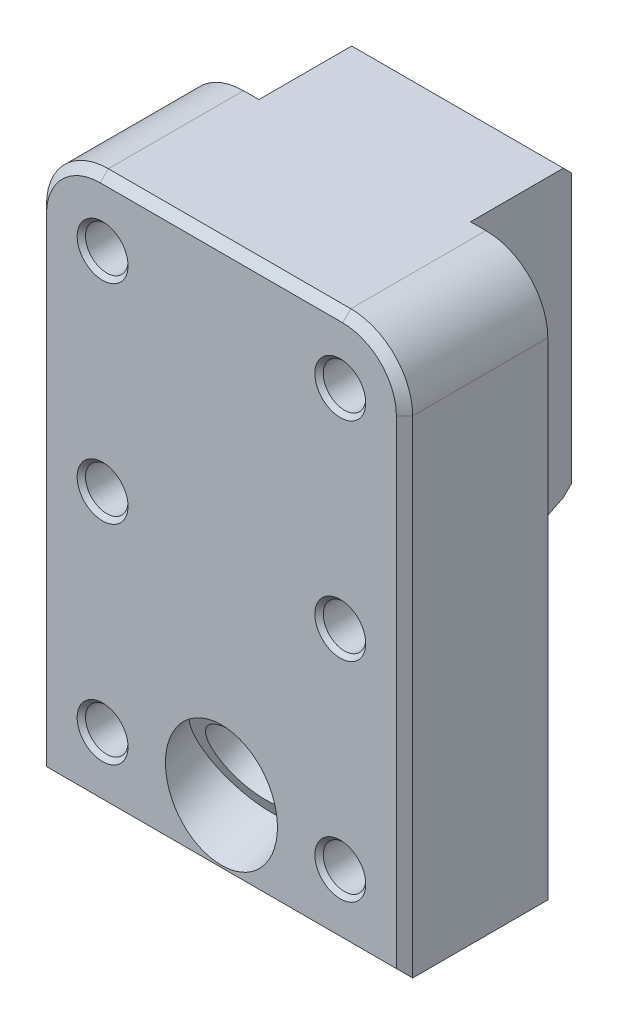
ISO-10303-21;
HEADER;
FILE_DESCRIPTION(('STEP AP214'),'2;1');
FILE_NAME('part.step','',(''),(''),'','','');
FILE_SCHEMA(('AUTOMOTIVE_DESIGN { 1 0 10303 214 1 1 1 1 }'));
ENDSEC;
DATA;
#1=APPLICATION_CONTEXT('core data for automotive mechanical design processes');
#2=APPLICATION_PROTOCOL_DEFINITION('international standard','automotive_design',2000,#1);
#3=PRODUCT_CONTEXT('',#1,'mechanical');
#4=PRODUCT('Part','Part','',(#3));
#5=PRODUCT_RELATED_PRODUCT_CATEGORY('part','',(#4));
#6=PRODUCT_DEFINITION_FORMATION('','',#4);
#7=PRODUCT_DEFINITION_CONTEXT('part definition',#1,'design');
#8=PRODUCT_DEFINITION('design','',#6,#7);
#9=PRODUCT_DEFINITION_SHAPE('','',#8);
#10=(LENGTH_UNIT() NAMED_UNIT(*) SI_UNIT(.MILLI.,.METRE.));
#11=(NAMED_UNIT(*) PLANE_ANGLE_UNIT() SI_UNIT($,.RADIAN.));
#12=(NAMED_UNIT(*) SI_UNIT($,.STERADIAN.) SOLID_ANGLE_UNIT());
#13=UNCERTAINTY_MEASURE_WITH_UNIT(LENGTH_MEASURE(1.E-05),#10,'distance_accuracy_value','');
#14=(GEOMETRIC_REPRESENTATION_CONTEXT(3) GLOBAL_UNCERTAINTY_ASSIGNED_CONTEXT((#13)) GLOBAL_UNIT_ASSIGNED_CONTEXT((#10,
#11,#12)) REPRESENTATION_CONTEXT('',''));
#15=CARTESIAN_POINT('',(0.,0.,0.));
#16=DIRECTION('',(0.,0.,1.));
#17=DIRECTION('',(1.,0.,0.));
#18=AXIS2_PLACEMENT_3D('',#15,#16,#17);
#19=CARTESIAN_POINT('',(0.,85.598,22.352));
#20=DIRECTION('',(0.,0.,-1.));
#21=DIRECTION('',(-1.,0.,0.));
#22=AXIS2_PLACEMENT_3D('',#19,#20,#21);
#23=PLANE('',#22);
#24=DIRECTION('',(0.999999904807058,-0.000436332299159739,0.));
#25=VECTOR('',#24,1.);
#26=CARTESIAN_POINT('',(22.510749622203,42.7972683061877,22.352));
#27=LINE('',#26,#25);
#28=CARTESIAN_POINT('',(22.5110036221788,42.7972681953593,22.352));
#29=VERTEX_POINT('',#28);
#30=CARTESIAN_POINT('',(22.510749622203,42.7972683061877,22.352));
#31=VERTEX_POINT('',#30);
#32=EDGE_CURVE('E457',#29,#31,#27,.F.);
#33=ORIENTED_EDGE('',*,*,#32,.F.);
#34=CARTESIAN_POINT('',(18.542,42.799,22.352));
#35=DIRECTION('',(0.,0.,1.));
#36=DIRECTION('',(1.,0.,0.));
#37=AXIS2_PLACEMENT_3D('',#34,#35,#36);
#38=CIRCLE('',#37,3.969004);
#39=CARTESIAN_POINT('',(22.511004,42.799,22.352));
#40=VERTEX_POINT('',#39);
#41=EDGE_CURVE('E408',#40,#29,#38,.T.);
#42=ORIENTED_EDGE('',*,*,#41,.F.);
#43=DIRECTION('',(1.,0.,0.));
#44=VECTOR('',#43,1.);
#45=CARTESIAN_POINT('',(22.51075,42.799,22.352));
#46=LINE('',#45,#44);
#47=CARTESIAN_POINT('',(22.51075,42.799,22.352));
#48=VERTEX_POINT('',#47);
#49=EDGE_CURVE('E43',#40,#48,#46,.F.);
#50=ORIENTED_EDGE('',*,*,#49,.T.);
#51=CARTESIAN_POINT('',(18.542,42.799,22.352));
#52=DIRECTION('',(0.,0.,-1.));
#53=DIRECTION('',(-1.,0.,0.));
#54=AXIS2_PLACEMENT_3D('',#51,#52,#53);
#55=CIRCLE('',#54,3.96875);
#56=EDGE_CURVE('E464',#48,#31,#55,.T.);
#57=ORIENTED_EDGE('',*,*,#56,.T.);
#58=EDGE_LOOP('',(#33,#42,#50,#57));
#59=FACE_BOUND('',#58,.T.);
#60=DIRECTION('',(0.999999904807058,-0.000436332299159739,0.));
#61=VECTOR('',#60,1.);
#62=CARTESIAN_POINT('',(-14.573250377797,75.3092683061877,22.352));
#63=LINE('',#62,#61);
#64=CARTESIAN_POINT('',(-14.5729963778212,75.3092681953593,22.352));
#65=VERTEX_POINT('',#64);
#66=CARTESIAN_POINT('',(-14.573250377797,75.3092683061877,22.352));
#67=VERTEX_POINT('',#66);
#68=EDGE_CURVE('E1960',#65,#67,#63,.F.);
#69=ORIENTED_EDGE('',*,*,#68,.F.);
#70=CARTESIAN_POINT('',(-18.542,75.311,22.352));
#71=DIRECTION('',(0.,0.,1.));
#72=DIRECTION('',(1.,0.,0.));
#73=AXIS2_PLACEMENT_3D('',#70,#71,#72);
#74=CIRCLE('',#73,3.969004);
#75=CARTESIAN_POINT('',(-14.572996,75.311,22.352));
#76=VERTEX_POINT('',#75);
#77=EDGE_CURVE('E1903',#76,#65,#74,.T.);
#78=ORIENTED_EDGE('',*,*,#77,.F.);
#79=DIRECTION('',(1.,0.,0.));
#80=VECTOR('',#79,1.);
#81=CARTESIAN_POINT('',(-14.57325,75.311,22.352));
#82=LINE('',#81,#80);
#83=CARTESIAN_POINT('',(-14.57325,75.311,22.352));
#84=VERTEX_POINT('',#83);
#85=EDGE_CURVE('E1854',#76,#84,#82,.F.);
#86=ORIENTED_EDGE('',*,*,#85,.T.);
#87=CARTESIAN_POINT('',(-18.542,75.311,22.352));
#88=DIRECTION('',(0.,0.,-1.));
#89=DIRECTION('',(-1.,0.,0.));
#90=AXIS2_PLACEMENT_3D('',#87,#88,#89);
#91=CIRCLE('',#90,3.96875);
#92=EDGE_CURVE('E1845',#84,#67,#91,.T.);
#93=ORIENTED_EDGE('',*,*,#92,.T.);
#94=EDGE_LOOP('',(#69,#78,#86,#93));
#95=FACE_BOUND('',#94,.T.);
#96=DIRECTION('',(0.999999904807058,-0.000436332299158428,0.));
#97=VECTOR('',#96,1.);
#98=CARTESIAN_POINT('',(-14.573250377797,10.2852683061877,22.352));
#99=LINE('',#98,#97);
#100=CARTESIAN_POINT('',(-14.5729963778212,10.2852681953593,22.352));
#101=VERTEX_POINT('',#100);
#102=CARTESIAN_POINT('',(-14.573250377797,10.2852683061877,22.352));
#103=VERTEX_POINT('',#102);
#104=EDGE_CURVE('E697',#101,#103,#99,.F.);
#105=ORIENTED_EDGE('',*,*,#104,.F.);
#106=CARTESIAN_POINT('',(-18.542,10.287,22.352));
#107=DIRECTION('',(0.,0.,1.));
#108=DIRECTION('',(1.,0.,0.));
#109=AXIS2_PLACEMENT_3D('',#106,#107,#108);
#110=CIRCLE('',#109,3.969004);
#111=CARTESIAN_POINT('',(-14.572996,10.287,22.352));
#112=VERTEX_POINT('',#111);
#113=EDGE_CURVE('E2044',#112,#101,#110,.T.);
#114=ORIENTED_EDGE('',*,*,#113,.F.);
#115=DIRECTION('',(1.,0.,0.));
#116=VECTOR('',#115,1.);
#117=CARTESIAN_POINT('',(-14.57325,10.287,22.352));
#118=LINE('',#117,#116);
#119=CARTESIAN_POINT('',(-14.57325,10.287,22.352));
#120=VERTEX_POINT('',#119);
#121=EDGE_CURVE('E701',#112,#120,#118,.F.);
#122=ORIENTED_EDGE('',*,*,#121,.T.);
#123=CARTESIAN_POINT('',(-18.542,10.287,22.352));
#124=DIRECTION('',(0.,0.,-1.));
#125=DIRECTION('',(-1.,0.,0.));
#126=AXIS2_PLACEMENT_3D('',#123,#124,#125);
#127=CIRCLE('',#126,3.96875);
#128=EDGE_CURVE('E669',#120,#103,#127,.T.);
#129=ORIENTED_EDGE('',*,*,#128,.T.);
#130=EDGE_LOOP('',(#105,#114,#122,#129));
#131=FACE_BOUND('',#130,.T.);
#132=DIRECTION('',(0.,-1.,0.));
#133=VECTOR('',#132,1.);
#134=CARTESIAN_POINT('',(-27.2923,0.,22.352));
#135=LINE('',#134,#133);
#136=CARTESIAN_POINT('',(-27.2923,75.946,22.352));
#137=VERTEX_POINT('',#136);
#138=CARTESIAN_POINT('',(-27.2923,1.27,22.352));
#139=VERTEX_POINT('',#138);
#140=EDGE_CURVE('E809',#137,#139,#135,.T.);
#141=ORIENTED_EDGE('',*,*,#140,.T.);
#142=DIRECTION('',(1.,0.,0.));
#143=VECTOR('',#142,1.);
#144=CARTESIAN_POINT('',(28.5623,1.27,22.352));
#145=LINE('',#144,#143);
#146=CARTESIAN_POINT('',(27.2923,1.27,22.352));
#147=VERTEX_POINT('',#146);
#148=EDGE_CURVE('E811',#139,#147,#145,.T.);
#149=ORIENTED_EDGE('',*,*,#148,.T.);
#150=DIRECTION('',(0.,1.,0.));
#151=VECTOR('',#150,1.);
#152=CARTESIAN_POINT('',(27.2923,85.598,22.352));
#153=LINE('',#152,#151);
#154=CARTESIAN_POINT('',(27.2923,75.946,22.352));
#155=VERTEX_POINT('',#154);
#156=EDGE_CURVE('E802',#147,#155,#153,.T.);
#157=ORIENTED_EDGE('',*,*,#156,.T.);
#158=CARTESIAN_POINT('',(18.9103,75.946,22.352));
#159=DIRECTION('',(0.,0.,-1.));
#160=DIRECTION('',(-1.,0.,0.));
#161=AXIS2_PLACEMENT_3D('',#158,#159,#160);
#162=CIRCLE('',#161,8.382);
#163=CARTESIAN_POINT('',(18.9103,84.328,22.352));
#164=VERTEX_POINT('',#163);
#165=EDGE_CURVE('E621',#155,#164,#162,.F.);
#166=ORIENTED_EDGE('',*,*,#165,.T.);
#167=DIRECTION('',(-1.,0.,0.));
#168=VECTOR('',#167,1.);
#169=CARTESIAN_POINT('',(0.,84.328,22.352));
#170=LINE('',#169,#168);
#171=CARTESIAN_POINT('',(-18.9103,84.328,22.352));
#172=VERTEX_POINT('',#171);
#173=EDGE_CURVE('E805',#164,#172,#170,.T.);
#174=ORIENTED_EDGE('',*,*,#173,.T.);
#175=CARTESIAN_POINT('',(-18.9103,75.946,22.352));
#176=DIRECTION('',(0.,0.,-1.));
#177=DIRECTION('',(-1.,0.,0.));
#178=AXIS2_PLACEMENT_3D('',#175,#176,#177);
#179=CIRCLE('',#178,8.382);
#180=EDGE_CURVE('E807',#172,#137,#179,.F.);
#181=ORIENTED_EDGE('',*,*,#180,.T.);
#182=EDGE_LOOP('',(#141,#149,#157,#166,#174,#181));
#183=FACE_BOUND('',#182,.T.);
#184=CARTESIAN_POINT('',(0.,11.0730822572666,22.352));
#185=DIRECTION('',(0.,0.,-1.));
#186=DIRECTION('',(0.,1.,0.));
#187=AXIS2_PLACEMENT_3D('',#184,#185,#186);
#188=ELLIPSE('',#187,9.49218243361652,8.7376);
#189=CARTESIAN_POINT('',(0.,20.5652646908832,22.352));
#190=VERTEX_POINT('',#189);
#191=EDGE_CURVE('E748',#190,#190,#188,.F.);
#192=ORIENTED_EDGE('',*,*,#191,.F.);
#193=EDGE_LOOP('',(#192));
#194=FACE_BOUND('',#193,.T.);
#195=DIRECTION('',(0.999999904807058,-0.000436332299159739,0.));
#196=VECTOR('',#195,1.);
#197=CARTESIAN_POINT('',(-14.573250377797,42.7972683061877,22.352));
#198=LINE('',#197,#196);
#199=CARTESIAN_POINT('',(-14.5729963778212,42.7972681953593,22.352));
#200=VERTEX_POINT('',#199);
#201=CARTESIAN_POINT('',(-14.573250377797,42.7972683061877,22.352));
#202=VERTEX_POINT('',#201);
#203=EDGE_CURVE('E1987',#200,#202,#198,.F.);
#204=ORIENTED_EDGE('',*,*,#203,.F.);
#205=CARTESIAN_POINT('',(-18.542,42.799,22.352));
#206=DIRECTION('',(0.,0.,1.));
#207=DIRECTION('',(1.,0.,0.));
#208=AXIS2_PLACEMENT_3D('',#205,#206,#207);
#209=CIRCLE('',#208,3.969004);
#210=CARTESIAN_POINT('',(-14.572996,42.799,22.352));
#211=VERTEX_POINT('',#210);
#212=EDGE_CURVE('E1937',#211,#200,#209,.T.);
#213=ORIENTED_EDGE('',*,*,#212,.F.);
#214=DIRECTION('',(1.,0.,0.));
#215=VECTOR('',#214,1.);
#216=CARTESIAN_POINT('',(-14.57325,42.799,22.352));
#217=LINE('',#216,#215);
#218=CARTESIAN_POINT('',(-14.57325,42.799,22.352));
#219=VERTEX_POINT('',#218);
#220=EDGE_CURVE('E1980',#211,#219,#217,.F.);
#221=ORIENTED_EDGE('',*,*,#220,.T.);
#222=CARTESIAN_POINT('',(-18.542,42.799,22.352));
#223=DIRECTION('',(0.,0.,-1.));
#224=DIRECTION('',(-1.,0.,0.));
#225=AXIS2_PLACEMENT_3D('',#222,#223,#224);
#226=CIRCLE('',#225,3.96875);
#227=EDGE_CURVE('E682',#219,#202,#226,.T.);
#228=ORIENTED_EDGE('',*,*,#227,.T.);
#229=EDGE_LOOP('',(#204,#213,#221,#228));
#230=FACE_BOUND('',#229,.T.);
#231=DIRECTION('',(0.999999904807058,-0.000436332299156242,0.));
#232=VECTOR('',#231,1.);
#233=CARTESIAN_POINT('',(22.510749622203,75.3092683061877,22.352));
#234=LINE('',#233,#232);
#235=CARTESIAN_POINT('',(22.5110036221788,75.3092681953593,22.352));
#236=VERTEX_POINT('',#235);
#237=CARTESIAN_POINT('',(22.510749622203,75.3092683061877,22.352));
#238=VERTEX_POINT('',#237);
#239=EDGE_CURVE('E1838',#236,#238,#234,.F.);
#240=ORIENTED_EDGE('',*,*,#239,.F.);
#241=CARTESIAN_POINT('',(18.542,75.311,22.352));
#242=DIRECTION('',(0.,0.,1.));
#243=DIRECTION('',(1.,0.,0.));
#244=AXIS2_PLACEMENT_3D('',#241,#242,#243);
#245=CIRCLE('',#244,3.969004);
#246=CARTESIAN_POINT('',(22.511004,75.311,22.352));
#247=VERTEX_POINT('',#246);
#248=EDGE_CURVE('E1802',#247,#236,#245,.T.);
#249=ORIENTED_EDGE('',*,*,#248,.F.);
#250=DIRECTION('',(1.,0.,0.));
#251=VECTOR('',#250,1.);
#252=CARTESIAN_POINT('',(22.51075,75.311,22.352));
#253=LINE('',#252,#251);
#254=CARTESIAN_POINT('',(22.51075,75.311,22.352));
#255=VERTEX_POINT('',#254);
#256=EDGE_CURVE('E1830',#247,#255,#253,.F.);
#257=ORIENTED_EDGE('',*,*,#256,.T.);
#258=CARTESIAN_POINT('',(18.542,75.311,22.352));
#259=DIRECTION('',(0.,0.,-1.));
#260=DIRECTION('',(-1.,0.,0.));
#261=AXIS2_PLACEMENT_3D('',#258,#259,#260);
#262=CIRCLE('',#261,3.96875);
#263=EDGE_CURVE('E1842',#255,#238,#262,.T.);
#264=ORIENTED_EDGE('',*,*,#263,.T.);
#265=EDGE_LOOP('',(#240,#249,#257,#264));
#266=FACE_BOUND('',#265,.T.);
#267=DIRECTION('',(0.999999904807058,-0.00043633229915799,0.));
#268=VECTOR('',#267,1.);
#269=CARTESIAN_POINT('',(22.510749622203,10.2852683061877,22.352));
#270=LINE('',#269,#268);
#271=CARTESIAN_POINT('',(22.5110036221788,10.2852681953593,22.352));
#272=VERTEX_POINT('',#271);
#273=CARTESIAN_POINT('',(22.510749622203,10.2852683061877,22.352));
#274=VERTEX_POINT('',#273);
#275=EDGE_CURVE('E430',#272,#274,#270,.F.);
#276=ORIENTED_EDGE('',*,*,#275,.F.);
#277=CARTESIAN_POINT('',(18.542,10.287,22.352));
#278=DIRECTION('',(0.,0.,1.));
#279=DIRECTION('',(1.,0.,0.));
#280=AXIS2_PLACEMENT_3D('',#277,#278,#279);
#281=CIRCLE('',#280,3.969004);
#282=CARTESIAN_POINT('',(22.511004,10.287,22.352));
#283=VERTEX_POINT('',#282);
#284=EDGE_CURVE('E492',#283,#272,#281,.T.);
#285=ORIENTED_EDGE('',*,*,#284,.F.);
#286=DIRECTION('',(1.,0.,0.));
#287=VECTOR('',#286,1.);
#288=CARTESIAN_POINT('',(22.51075,10.287,22.352));
#289=LINE('',#288,#287);
#290=CARTESIAN_POINT('',(22.51075,10.287,22.352));
#291=VERTEX_POINT('',#290);
#292=EDGE_CURVE('E22',#283,#291,#289,.F.);
#293=ORIENTED_EDGE('',*,*,#292,.T.);
#294=CARTESIAN_POINT('',(18.542,10.287,22.352));
#295=DIRECTION('',(0.,0.,-1.));
#296=DIRECTION('',(-1.,0.,0.));
#297=AXIS2_PLACEMENT_3D('',#294,#295,#296);
#298=CIRCLE('',#297,3.96875);
#299=EDGE_CURVE('E460',#291,#274,#298,.T.);
#300=ORIENTED_EDGE('',*,*,#299,.T.);
#301=EDGE_LOOP('',(#276,#285,#293,#300));
#302=FACE_BOUND('',#301,.T.);
#303=ADVANCED_FACE('F18',(#59,#95,#131,#183,#194,#230,#266,#302),#23,.F.);
#304=CARTESIAN_POINT('',(-16.51,85.598,0.));
#305=DIRECTION('',(-1.,0.,0.));
#306=DIRECTION('',(0.,0.,1.));
#307=AXIS2_PLACEMENT_3D('',#304,#305,#306);
#308=PLANE('',#307);
#309=DIRECTION('',(0.,-1.,0.));
#310=VECTOR('',#309,1.);
#311=CARTESIAN_POINT('',(-16.51,85.598,-15.748));
#312=LINE('',#311,#310);
#313=CARTESIAN_POINT('',(-16.51,84.328,-15.748));
#314=VERTEX_POINT('',#313);
#315=CARTESIAN_POINT('',(-16.51,42.3652821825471,-15.748));
#316=VERTEX_POINT('',#315);
#317=EDGE_CURVE('E762',#314,#316,#312,.T.);
#318=ORIENTED_EDGE('',*,*,#317,.T.);
#319=DIRECTION('',(0.,0.707106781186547,-0.707106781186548));
#320=VECTOR('',#319,1.);
#321=CARTESIAN_POINT('',(-16.51,56.1076410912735,-29.4903589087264));
#322=LINE('',#321,#320);
#323=CARTESIAN_POINT('',(-16.51,41.1009034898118,-14.4836213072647));
#324=VERTEX_POINT('',#323);
#325=EDGE_CURVE('E634',#316,#324,#322,.F.);
#326=ORIENTED_EDGE('',*,*,#325,.T.);
#327=DIRECTION('',(0.,0.438371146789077,-0.898794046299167));
#328=VECTOR('',#327,1.);
#329=CARTESIAN_POINT('',(-16.51,43.9452530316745,-20.3154020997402));
#330=LINE('',#329,#328);
#331=CARTESIAN_POINT('',(-16.51,34.7325381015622,-1.42653728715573));
#332=VERTEX_POINT('',#331);
#333=EDGE_CURVE('E747',#332,#324,#330,.T.);
#334=ORIENTED_EDGE('',*,*,#333,.F.);
#335=CARTESIAN_POINT('',(-16.51,32.4496012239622,-2.54));
#336=DIRECTION('',(-1.,0.,0.));
#337=DIRECTION('',(0.,0.,1.));
#338=AXIS2_PLACEMENT_3D('',#335,#336,#337);
#339=CIRCLE('',#338,2.54);
#340=CARTESIAN_POINT('',(-16.51,32.4496012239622,0.));
#341=VERTEX_POINT('',#340);
#342=EDGE_CURVE('E653',#332,#341,#339,.F.);
#343=ORIENTED_EDGE('',*,*,#342,.T.);
#344=DIRECTION('',(0.,-1.,0.));
#345=VECTOR('',#344,1.);
#346=CARTESIAN_POINT('',(-16.51,85.598,0.));
#347=LINE('',#346,#345);
#348=CARTESIAN_POINT('',(-16.51,85.598,0.));
#349=VERTEX_POINT('',#348);
#350=EDGE_CURVE('E759',#349,#341,#347,.T.);
#351=ORIENTED_EDGE('',*,*,#350,.F.);
#352=DIRECTION('',(0.,0.,1.));
#353=VECTOR('',#352,1.);
#354=CARTESIAN_POINT('',(-16.51,85.598,0.));
#355=LINE('',#354,#353);
#356=CARTESIAN_POINT('',(-16.51,85.598,-14.478));
#357=VERTEX_POINT('',#356);
#358=EDGE_CURVE('E663',#357,#349,#355,.T.);
#359=ORIENTED_EDGE('',*,*,#358,.F.);
#360=DIRECTION('',(0.,0.707106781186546,0.70710678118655));
#361=VECTOR('',#360,1.);
#362=CARTESIAN_POINT('',(-16.51,92.837,-7.239));
#363=LINE('',#362,#361);
#364=EDGE_CURVE('E793',#357,#314,#363,.F.);
#365=ORIENTED_EDGE('',*,*,#364,.T.);
#366=EDGE_LOOP('',(#318,#326,#334,#343,#351,#359,#365));
#367=FACE_BOUND('',#366,.T.);
#368=ADVANCED_FACE('F529',(#367),#308,.T.);
#369=CARTESIAN_POINT('',(16.51,85.598,0.));
#370=DIRECTION('',(-1.,0.,0.));
#371=DIRECTION('',(0.,0.,1.));
#372=AXIS2_PLACEMENT_3D('',#369,#370,#371);
#373=PLANE('',#372);
#374=DIRECTION('',(0.,-1.,0.));
#375=VECTOR('',#374,1.);
#376=CARTESIAN_POINT('',(16.51,85.598,0.));
#377=LINE('',#376,#375);
#378=CARTESIAN_POINT('',(16.51,85.598,0.));
#379=VERTEX_POINT('',#378);
#380=CARTESIAN_POINT('',(16.51,32.4496012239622,0.));
#381=VERTEX_POINT('',#380);
#382=EDGE_CURVE('E768',#379,#381,#377,.T.);
#383=ORIENTED_EDGE('',*,*,#382,.T.);
#384=CARTESIAN_POINT('',(16.51,32.4496012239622,-2.54));
#385=DIRECTION('',(-1.,0.,0.));
#386=DIRECTION('',(0.,0.,1.));
#387=AXIS2_PLACEMENT_3D('',#384,#385,#386);
#388=CIRCLE('',#387,2.54);
#389=CARTESIAN_POINT('',(16.51,34.7325381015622,-1.42653728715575));
#390=VERTEX_POINT('',#389);
#391=EDGE_CURVE('E656',#381,#390,#388,.T.);
#392=ORIENTED_EDGE('',*,*,#391,.T.);
#393=DIRECTION('',(0.,0.438371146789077,-0.898794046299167));
#394=VECTOR('',#393,1.);
#395=CARTESIAN_POINT('',(16.51,43.9452530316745,-20.3154020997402));
#396=LINE('',#395,#394);
#397=CARTESIAN_POINT('',(16.51,41.1009034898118,-14.4836213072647));
#398=VERTEX_POINT('',#397);
#399=EDGE_CURVE('E745',#390,#398,#396,.T.);
#400=ORIENTED_EDGE('',*,*,#399,.T.);
#401=DIRECTION('',(0.,-0.707106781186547,0.707106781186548));
#402=VECTOR('',#401,1.);
#403=CARTESIAN_POINT('',(16.51,42.3652821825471,-15.748));
#404=LINE('',#403,#402);
#405=CARTESIAN_POINT('',(16.51,42.3652821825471,-15.748));
#406=VERTEX_POINT('',#405);
#407=EDGE_CURVE('E645',#398,#406,#404,.F.);
#408=ORIENTED_EDGE('',*,*,#407,.T.);
#409=DIRECTION('',(0.,-1.,0.));
#410=VECTOR('',#409,1.);
#411=CARTESIAN_POINT('',(16.51,85.598,-15.748));
#412=LINE('',#411,#410);
#413=CARTESIAN_POINT('',(16.51,84.328,-15.748));
#414=VERTEX_POINT('',#413);
#415=EDGE_CURVE('E765',#414,#406,#412,.T.);
#416=ORIENTED_EDGE('',*,*,#415,.F.);
#417=DIRECTION('',(0.,-0.707106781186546,-0.70710678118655));
#418=VECTOR('',#417,1.);
#419=CARTESIAN_POINT('',(16.51,85.598,-14.478));
#420=LINE('',#419,#418);
#421=CARTESIAN_POINT('',(16.51,85.598,-14.478));
#422=VERTEX_POINT('',#421);
#423=EDGE_CURVE('E797',#414,#422,#420,.F.);
#424=ORIENTED_EDGE('',*,*,#423,.T.);
#425=DIRECTION('',(0.,0.,1.));
#426=VECTOR('',#425,1.);
#427=CARTESIAN_POINT('',(16.51,85.598,0.));
#428=LINE('',#427,#426);
#429=EDGE_CURVE('E744',#422,#379,#428,.T.);
#430=ORIENTED_EDGE('',*,*,#429,.T.);
#431=EDGE_LOOP('',(#383,#392,#400,#408,#416,#424,#430));
#432=FACE_BOUND('',#431,.T.);
#433=ADVANCED_FACE('F535',(#432),#373,.F.);
#434=CARTESIAN_POINT('',(16.51,85.598,-15.748));
#435=DIRECTION('',(0.,0.,1.));
#436=DIRECTION('',(1.,0.,0.));
#437=AXIS2_PLACEMENT_3D('',#434,#435,#436);
#438=PLANE('',#437);
#439=ORIENTED_EDGE('',*,*,#415,.T.);
#440=DIRECTION('',(-1.,0.,0.));
#441=VECTOR('',#440,1.);
#442=CARTESIAN_POINT('',(16.51,42.3652821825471,-15.748));
#443=LINE('',#442,#441);
#444=EDGE_CURVE('E631',#406,#316,#443,.T.);
#445=ORIENTED_EDGE('',*,*,#444,.T.);
#446=ORIENTED_EDGE('',*,*,#317,.F.);
#447=DIRECTION('',(1.,0.,0.));
#448=VECTOR('',#447,1.);
#449=CARTESIAN_POINT('',(16.51,84.328,-15.748));
#450=LINE('',#449,#448);
#451=EDGE_CURVE('E795',#314,#414,#450,.T.);
#452=ORIENTED_EDGE('',*,*,#451,.T.);
#453=EDGE_LOOP('',(#439,#445,#446,#452));
#454=FACE_BOUND('',#453,.T.);
#455=ADVANCED_FACE('F552',(#454),#438,.F.);
#456=CARTESIAN_POINT('',(-16.51,85.598,22.352));
#457=DIRECTION('',(0.,-1.,0.));
#458=DIRECTION('',(0.,0.,-1.));
#459=AXIS2_PLACEMENT_3D('',#456,#457,#458);
#460=PLANE('',#459);
#461=DIRECTION('',(0.,0.,1.));
#462=VECTOR('',#461,1.);
#463=CARTESIAN_POINT('',(-18.9103,85.598,22.352));
#464=LINE('',#463,#462);
#465=CARTESIAN_POINT('',(-18.9103,85.598,0.));
#466=VERTEX_POINT('',#465);
#467=CARTESIAN_POINT('',(-18.9103,85.598,21.082));
#468=VERTEX_POINT('',#467);
#469=EDGE_CURVE('E783',#466,#468,#464,.T.);
#470=ORIENTED_EDGE('',*,*,#469,.T.);
#471=DIRECTION('',(1.,0.,0.));
#472=VECTOR('',#471,1.);
#473=CARTESIAN_POINT('',(-16.51,85.598,21.082));
#474=LINE('',#473,#472);
#475=CARTESIAN_POINT('',(18.9103,85.598,21.082));
#476=VERTEX_POINT('',#475);
#477=EDGE_CURVE('E636',#468,#476,#474,.T.);
#478=ORIENTED_EDGE('',*,*,#477,.T.);
#479=DIRECTION('',(0.,0.,1.));
#480=VECTOR('',#479,1.);
#481=CARTESIAN_POINT('',(18.9103,85.598,22.352));
#482=LINE('',#481,#480);
#483=CARTESIAN_POINT('',(18.9103,85.598,0.));
#484=VERTEX_POINT('',#483);
#485=EDGE_CURVE('E779',#476,#484,#482,.F.);
#486=ORIENTED_EDGE('',*,*,#485,.T.);
#487=DIRECTION('',(-1.,0.,0.));
#488=VECTOR('',#487,1.);
#489=CARTESIAN_POINT('',(28.5623,85.598,0.));
#490=LINE('',#489,#488);
#491=EDGE_CURVE('E758',#484,#379,#490,.T.);
#492=ORIENTED_EDGE('',*,*,#491,.T.);
#493=ORIENTED_EDGE('',*,*,#429,.F.);
#494=DIRECTION('',(-1.,0.,0.));
#495=VECTOR('',#494,1.);
#496=CARTESIAN_POINT('',(-16.51,85.598,-14.478));
#497=LINE('',#496,#495);
#498=EDGE_CURVE('E610',#422,#357,#497,.T.);
#499=ORIENTED_EDGE('',*,*,#498,.T.);
#500=ORIENTED_EDGE('',*,*,#358,.T.);
#501=EDGE_CURVE('E755',#349,#466,#490,.T.);
#502=ORIENTED_EDGE('',*,*,#501,.T.);
#503=EDGE_LOOP('',(#470,#478,#486,#492,#493,#499,#500,#502));
#504=FACE_BOUND('',#503,.T.);
#505=ADVANCED_FACE('F542',(#504),#460,.F.);
#506=CARTESIAN_POINT('',(-16.51,0.,22.352));
#507=DIRECTION('',(0.,-1.,0.));
#508=DIRECTION('',(0.,0.,-1.));
#509=AXIS2_PLACEMENT_3D('',#506,#507,#508);
#510=PLANE('',#509);
#511=DIRECTION('',(0.,0.,-1.));
#512=VECTOR('',#511,1.);
#513=CARTESIAN_POINT('',(28.5623,0.,22.352));
#514=LINE('',#513,#512);
#515=CARTESIAN_POINT('',(28.5623,0.,21.082));
#516=VERTEX_POINT('',#515);
#517=CARTESIAN_POINT('',(28.5623,0.,0.));
#518=VERTEX_POINT('',#517);
#519=EDGE_CURVE('E754',#516,#518,#514,.T.);
#520=ORIENTED_EDGE('',*,*,#519,.F.);
#521=DIRECTION('',(-1.,0.,0.));
#522=VECTOR('',#521,1.);
#523=CARTESIAN_POINT('',(-28.5623,0.,21.082));
#524=LINE('',#523,#522);
#525=CARTESIAN_POINT('',(-28.5623,0.,21.082));
#526=VERTEX_POINT('',#525);
#527=EDGE_CURVE('E799',#516,#526,#524,.T.);
#528=ORIENTED_EDGE('',*,*,#527,.T.);
#529=DIRECTION('',(0.,0.,-1.));
#530=VECTOR('',#529,1.);
#531=CARTESIAN_POINT('',(-28.5623,0.,22.352));
#532=LINE('',#531,#530);
#533=CARTESIAN_POINT('',(-28.5623,0.,0.));
#534=VERTEX_POINT('',#533);
#535=EDGE_CURVE('E750',#526,#534,#532,.T.);
#536=ORIENTED_EDGE('',*,*,#535,.T.);
#537=DIRECTION('',(-1.,0.,0.));
#538=VECTOR('',#537,1.);
#539=CARTESIAN_POINT('',(28.5623,0.,0.));
#540=LINE('',#539,#538);
#541=EDGE_CURVE('E751',#518,#534,#540,.T.);
#542=ORIENTED_EDGE('',*,*,#541,.F.);
#543=EDGE_LOOP('',(#520,#528,#536,#542));
#544=FACE_BOUND('',#543,.T.);
#545=ADVANCED_FACE('F588',(#544),#510,.T.);
#546=CARTESIAN_POINT('',(-28.5623,85.598,22.352));
#547=DIRECTION('',(-1.,0.,0.));
#548=DIRECTION('',(0.,0.,1.));
#549=AXIS2_PLACEMENT_3D('',#546,#547,#548);
#550=PLANE('',#549);
#551=ORIENTED_EDGE('',*,*,#535,.F.);
#552=DIRECTION('',(0.,1.,0.));
#553=VECTOR('',#552,1.);
#554=CARTESIAN_POINT('',(-28.5623,75.946,21.082));
#555=LINE('',#554,#553);
#556=CARTESIAN_POINT('',(-28.5623,75.946,21.082));
#557=VERTEX_POINT('',#556);
#558=EDGE_CURVE('E814',#526,#557,#555,.T.);
#559=ORIENTED_EDGE('',*,*,#558,.T.);
#560=DIRECTION('',(0.,0.,1.));
#561=VECTOR('',#560,1.);
#562=CARTESIAN_POINT('',(-28.5623,75.946,0.));
#563=LINE('',#562,#561);
#564=CARTESIAN_POINT('',(-28.5623,75.946,0.));
#565=VERTEX_POINT('',#564);
#566=EDGE_CURVE('E786',#557,#565,#563,.F.);
#567=ORIENTED_EDGE('',*,*,#566,.T.);
#568=DIRECTION('',(0.,-1.,0.));
#569=VECTOR('',#568,1.);
#570=CARTESIAN_POINT('',(-28.5623,85.598,0.));
#571=LINE('',#570,#569);
#572=EDGE_CURVE('E761',#565,#534,#571,.T.);
#573=ORIENTED_EDGE('',*,*,#572,.T.);
#574=EDGE_LOOP('',(#551,#559,#567,#573));
#575=FACE_BOUND('',#574,.T.);
#576=ADVANCED_FACE('F548',(#575),#550,.T.);
#577=CARTESIAN_POINT('',(28.5623,85.598,0.));
#578=DIRECTION('',(0.,0.,1.));
#579=DIRECTION('',(1.,0.,0.));
#580=AXIS2_PLACEMENT_3D('',#577,#578,#579);
#581=PLANE('',#580);
#582=ORIENTED_EDGE('',*,*,#350,.T.);
#583=DIRECTION('',(-1.,0.,0.));
#584=VECTOR('',#583,1.);
#585=CARTESIAN_POINT('',(16.51,32.4496012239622,0.));
#586=LINE('',#585,#584);
#587=EDGE_CURVE('E650',#341,#381,#586,.F.);
#588=ORIENTED_EDGE('',*,*,#587,.T.);
#589=ORIENTED_EDGE('',*,*,#382,.F.);
#590=ORIENTED_EDGE('',*,*,#491,.F.);
#591=CARTESIAN_POINT('',(18.9103,75.946,0.));
#592=DIRECTION('',(0.,0.,1.));
#593=DIRECTION('',(1.,0.,0.));
#594=AXIS2_PLACEMENT_3D('',#591,#592,#593);
#595=CIRCLE('',#594,9.652);
#596=CARTESIAN_POINT('',(28.5623,75.946,0.));
#597=VERTEX_POINT('',#596);
#598=EDGE_CURVE('E788',#484,#597,#595,.F.);
#599=ORIENTED_EDGE('',*,*,#598,.T.);
#600=DIRECTION('',(0.,-1.,0.));
#601=VECTOR('',#600,1.);
#602=CARTESIAN_POINT('',(28.5623,85.598,0.));
#603=LINE('',#602,#601);
#604=EDGE_CURVE('E607',#597,#518,#603,.T.);
#605=ORIENTED_EDGE('',*,*,#604,.T.);
#606=ORIENTED_EDGE('',*,*,#541,.T.);
#607=ORIENTED_EDGE('',*,*,#572,.F.);
#608=CARTESIAN_POINT('',(-18.9103,75.946,0.));
#609=DIRECTION('',(0.,0.,1.));
#610=DIRECTION('',(1.,0.,0.));
#611=AXIS2_PLACEMENT_3D('',#608,#609,#610);
#612=CIRCLE('',#611,9.652);
#613=EDGE_CURVE('E611',#565,#466,#612,.F.);
#614=ORIENTED_EDGE('',*,*,#613,.T.);
#615=ORIENTED_EDGE('',*,*,#501,.F.);
#616=EDGE_LOOP('',(#582,#588,#589,#590,#599,#605,#606,#607,#614,#615));
#617=FACE_BOUND('',#616,.T.);
#618=CARTESIAN_POINT('',(0.,20.5609433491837,0.));
#619=DIRECTION('',(0.,0.,1.));
#620=DIRECTION('',(0.,-1.,0.));
#621=AXIS2_PLACEMENT_3D('',#618,#619,#620);
#622=ELLIPSE('',#621,6.90528678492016,6.35635);
#623=CARTESIAN_POINT('',(0.,13.6556565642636,0.));
#624=VERTEX_POINT('',#623);
#625=EDGE_CURVE('E662',#624,#624,#622,.T.);
#626=ORIENTED_EDGE('',*,*,#625,.T.);
#627=EDGE_LOOP('',(#626));
#628=FACE_BOUND('',#627,.T.);
#629=ADVANCED_FACE('F544',(#617,#628),#581,.F.);
#630=CARTESIAN_POINT('',(28.5623,85.598,22.352));
#631=DIRECTION('',(-1.,0.,0.));
#632=DIRECTION('',(0.,0.,1.));
#633=AXIS2_PLACEMENT_3D('',#630,#631,#632);
#634=PLANE('',#633);
#635=DIRECTION('',(0.,0.,1.));
#636=VECTOR('',#635,1.);
#637=CARTESIAN_POINT('',(28.5623,75.946,22.352));
#638=LINE('',#637,#636);
#639=CARTESIAN_POINT('',(28.5623,75.946,21.082));
#640=VERTEX_POINT('',#639);
#641=EDGE_CURVE('E601',#597,#640,#638,.T.);
#642=ORIENTED_EDGE('',*,*,#641,.T.);
#643=DIRECTION('',(0.,-1.,0.));
#644=VECTOR('',#643,1.);
#645=CARTESIAN_POINT('',(28.5623,85.598,21.082));
#646=LINE('',#645,#644);
#647=EDGE_CURVE('E604',#640,#516,#646,.T.);
#648=ORIENTED_EDGE('',*,*,#647,.T.);
#649=ORIENTED_EDGE('',*,*,#519,.T.);
#650=ORIENTED_EDGE('',*,*,#604,.F.);
#651=EDGE_LOOP('',(#642,#648,#649,#650));
#652=FACE_BOUND('',#651,.T.);
#653=ADVANCED_FACE('F547',(#652),#634,.F.);
#654=CARTESIAN_POINT('',(191.102264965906,34.036769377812,0.));
#655=DIRECTION('',(0.,0.898794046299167,0.438371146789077));
#656=DIRECTION('',(0.,-0.438371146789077,0.898794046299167));
#657=AXIS2_PLACEMENT_3D('',#654,#655,#656);
#658=PLANE('',#657);
#659=ORIENTED_EDGE('',*,*,#399,.F.);
#660=DIRECTION('',(-1.,0.,0.));
#661=VECTOR('',#660,1.);
#662=CARTESIAN_POINT('',(-16.51,34.7325381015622,-1.42653728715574));
#663=LINE('',#662,#661);
#664=EDGE_CURVE('E647',#390,#332,#663,.T.);
#665=ORIENTED_EDGE('',*,*,#664,.T.);
#666=ORIENTED_EDGE('',*,*,#333,.T.);
#667=DIRECTION('',(1.,0.,0.));
#668=VECTOR('',#667,1.);
#669=CARTESIAN_POINT('',(191.102264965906,41.1009034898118,-14.4836213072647));
#670=LINE('',#669,#668);
#671=EDGE_CURVE('E642',#324,#398,#670,.T.);
#672=ORIENTED_EDGE('',*,*,#671,.T.);
#673=EDGE_LOOP('',(#659,#665,#666,#672));
#674=FACE_BOUND('',#673,.T.);
#675=ADVANCED_FACE('F591',(#674),#658,.F.);
#676=CARTESIAN_POINT('',(0.,2.46498981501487,42.6313949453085));
#677=DIRECTION('',(0.,0.390731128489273,-0.92050485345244));
#678=DIRECTION('',(0.,0.92050485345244,0.390731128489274));
#679=AXIS2_PLACEMENT_3D('',#676,#677,#678);
#680=CYLINDRICAL_SURFACE('',#679,8.7376);
#681=CARTESIAN_POINT('',(0.,12.9093201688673,18.0260945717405));
#682=DIRECTION('',(0.,-0.390731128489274,0.920504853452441));
#683=DIRECTION('',(0.,-0.92050485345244,-0.390731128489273));
#684=AXIS2_PLACEMENT_3D('',#681,#682,#683);
#685=CIRCLE('',#684,8.7376);
#686=CARTESIAN_POINT('',(0.,4.86631696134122,14.6120422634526));
#687=VERTEX_POINT('',#686);
#688=EDGE_CURVE('E666',#687,#687,#685,.T.);
#689=ORIENTED_EDGE('',*,*,#688,.F.);
#690=EDGE_LOOP('',(#689));
#691=FACE_BOUND('',#690,.T.);
#692=ORIENTED_EDGE('',*,*,#191,.T.);
#693=EDGE_LOOP('',(#692));
#694=FACE_BOUND('',#693,.T.);
#695=ADVANCED_FACE('F560',(#691,#694),#680,.F.);
#696=CARTESIAN_POINT('',(0.,12.9093201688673,18.0260945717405));
#697=DIRECTION('',(0.,-0.390731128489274,0.920504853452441));
#698=DIRECTION('',(0.,-0.92050485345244,-0.390731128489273));
#699=AXIS2_PLACEMENT_3D('',#696,#697,#698);
#700=PLANE('',#699);
#701=CARTESIAN_POINT('',(0.,12.9093201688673,18.0260945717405));
#702=DIRECTION('',(0.,-0.390731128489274,0.920504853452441));
#703=DIRECTION('',(0.,-0.92050485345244,-0.390731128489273));
#704=AXIS2_PLACEMENT_3D('',#701,#702,#703);
#705=CIRCLE('',#704,6.35635);
#706=CARTESIAN_POINT('',(0.,7.05826914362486,15.5424707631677));
#707=VERTEX_POINT('',#706);
#708=EDGE_CURVE('E659',#707,#707,#705,.T.);
#709=ORIENTED_EDGE('',*,*,#708,.F.);
#710=EDGE_LOOP('',(#709));
#711=FACE_BOUND('',#710,.T.);
#712=ORIENTED_EDGE('',*,*,#688,.T.);
#713=EDGE_LOOP('',(#712));
#714=FACE_BOUND('',#713,.T.);
#715=ADVANCED_FACE('F557',(#711,#714),#700,.T.);
#716=CARTESIAN_POINT('',(0.,22.31413114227,-4.1302516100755));
#717=DIRECTION('',(0.,-0.390731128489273,0.92050485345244));
#718=DIRECTION('',(0.,-0.92050485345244,-0.390731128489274));
#719=AXIS2_PLACEMENT_3D('',#716,#717,#718);
#720=CYLINDRICAL_SURFACE('',#719,6.35635);
#721=ORIENTED_EDGE('',*,*,#708,.T.);
#722=EDGE_LOOP('',(#721));
#723=FACE_BOUND('',#722,.T.);
#724=ORIENTED_EDGE('',*,*,#625,.F.);
#725=EDGE_LOOP('',(#724));
#726=FACE_BOUND('',#725,.T.);
#727=ADVANCED_FACE('F20',(#723,#726),#720,.F.);
#728=CARTESIAN_POINT('',(-18.542,10.287,7.112));
#729=DIRECTION('',(0.,0.,1.));
#730=DIRECTION('',(1.,0.,0.));
#731=AXIS2_PLACEMENT_3D('',#728,#729,#730);
#732=CYLINDRICAL_SURFACE('',#731,3.3147);
#733=CARTESIAN_POINT('',(-18.542,10.287,21.69795));
#734=DIRECTION('',(0.,0.,-1.));
#735=DIRECTION('',(-1.,0.,0.));
#736=AXIS2_PLACEMENT_3D('',#733,#734,#735);
#737=CIRCLE('',#736,3.3147);
#738=CARTESIAN_POINT('',(-21.8567,10.287,21.69795));
#739=VERTEX_POINT('',#738);
#740=EDGE_CURVE('E11',#739,#739,#737,.F.);
#741=ORIENTED_EDGE('',*,*,#740,.T.);
#742=EDGE_LOOP('',(#741));
#743=FACE_BOUND('',#742,.T.);
#744=CARTESIAN_POINT('',(-18.542,10.287,5.207));
#745=DIRECTION('',(0.,0.,-1.));
#746=DIRECTION('',(-1.,0.,0.));
#747=AXIS2_PLACEMENT_3D('',#744,#745,#746);
#748=CIRCLE('',#747,3.3147);
#749=CARTESIAN_POINT('',(-21.8567,10.287,5.207));
#750=VERTEX_POINT('',#749);
#751=EDGE_CURVE('E732',#750,#750,#748,.T.);
#752=ORIENTED_EDGE('',*,*,#751,.T.);
#753=EDGE_LOOP('',(#752));
#754=FACE_BOUND('',#753,.T.);
#755=ADVANCED_FACE('F566',(#743,#754),#732,.F.);
#756=CARTESIAN_POINT('',(-18.542,42.799,7.112));
#757=DIRECTION('',(0.,0.,1.));
#758=DIRECTION('',(1.,0.,0.));
#759=AXIS2_PLACEMENT_3D('',#756,#757,#758);
#760=CYLINDRICAL_SURFACE('',#759,3.3147);
#761=CARTESIAN_POINT('',(-18.542,42.799,21.69795));
#762=DIRECTION('',(0.,0.,-1.));
#763=DIRECTION('',(-1.,0.,0.));
#764=AXIS2_PLACEMENT_3D('',#761,#762,#763);
#765=CIRCLE('',#764,3.3147);
#766=CARTESIAN_POINT('',(-21.8567,42.799,21.69795));
#767=VERTEX_POINT('',#766);
#768=EDGE_CURVE('E28',#767,#767,#765,.F.);
#769=ORIENTED_EDGE('',*,*,#768,.T.);
#770=EDGE_LOOP('',(#769));
#771=FACE_BOUND('',#770,.T.);
#772=CARTESIAN_POINT('',(-18.542,42.799,5.207));
#773=DIRECTION('',(0.,0.,-1.));
#774=DIRECTION('',(-1.,0.,0.));
#775=AXIS2_PLACEMENT_3D('',#772,#773,#774);
#776=CIRCLE('',#775,3.3147);
#777=CARTESIAN_POINT('',(-21.8567,42.799,5.207));
#778=VERTEX_POINT('',#777);
#779=EDGE_CURVE('E729',#778,#778,#776,.T.);
#780=ORIENTED_EDGE('',*,*,#779,.T.);
#781=EDGE_LOOP('',(#780));
#782=FACE_BOUND('',#781,.T.);
#783=ADVANCED_FACE('F562',(#771,#782),#760,.F.);
#784=CARTESIAN_POINT('',(-18.542,75.311,7.112));
#785=DIRECTION('',(0.,0.,1.));
#786=DIRECTION('',(1.,0.,0.));
#787=AXIS2_PLACEMENT_3D('',#784,#785,#786);
#788=CYLINDRICAL_SURFACE('',#787,3.3147);
#789=CARTESIAN_POINT('',(-18.542,75.311,21.69795));
#790=DIRECTION('',(0.,0.,-1.));
#791=DIRECTION('',(-1.,0.,0.));
#792=AXIS2_PLACEMENT_3D('',#789,#790,#791);
#793=CIRCLE('',#792,3.3147);
#794=CARTESIAN_POINT('',(-21.8567,75.311,21.69795));
#795=VERTEX_POINT('',#794);
#796=EDGE_CURVE('E675',#795,#795,#793,.F.);
#797=ORIENTED_EDGE('',*,*,#796,.T.);
#798=EDGE_LOOP('',(#797));
#799=FACE_BOUND('',#798,.T.);
#800=CARTESIAN_POINT('',(-18.542,75.311,5.207));
#801=DIRECTION('',(0.,0.,-1.));
#802=DIRECTION('',(-1.,0.,0.));
#803=AXIS2_PLACEMENT_3D('',#800,#801,#802);
#804=CIRCLE('',#803,3.3147);
#805=CARTESIAN_POINT('',(-21.8567,75.311,5.207));
#806=VERTEX_POINT('',#805);
#807=EDGE_CURVE('E726',#806,#806,#804,.T.);
#808=ORIENTED_EDGE('',*,*,#807,.T.);
#809=EDGE_LOOP('',(#808));
#810=FACE_BOUND('',#809,.T.);
#811=ADVANCED_FACE('F565',(#799,#810),#788,.F.);
#812=CARTESIAN_POINT('',(18.542,75.311,7.112));
#813=DIRECTION('',(0.,0.,1.));
#814=DIRECTION('',(1.,0.,0.));
#815=AXIS2_PLACEMENT_3D('',#812,#813,#814);
#816=CYLINDRICAL_SURFACE('',#815,3.3147);
#817=CARTESIAN_POINT('',(18.542,75.311,21.69795));
#818=DIRECTION('',(0.,0.,-1.));
#819=DIRECTION('',(-1.,0.,0.));
#820=AXIS2_PLACEMENT_3D('',#817,#818,#819);
#821=CIRCLE('',#820,3.3147);
#822=CARTESIAN_POINT('',(15.2273,75.311,21.69795));
#823=VERTEX_POINT('',#822);
#824=EDGE_CURVE('E672',#823,#823,#821,.F.);
#825=ORIENTED_EDGE('',*,*,#824,.T.);
#826=EDGE_LOOP('',(#825));
#827=FACE_BOUND('',#826,.T.);
#828=CARTESIAN_POINT('',(18.542,75.311,5.207));
#829=DIRECTION('',(0.,0.,-1.));
#830=DIRECTION('',(-1.,0.,0.));
#831=AXIS2_PLACEMENT_3D('',#828,#829,#830);
#832=CIRCLE('',#831,3.3147);
#833=CARTESIAN_POINT('',(15.2273,75.311,5.207));
#834=VERTEX_POINT('',#833);
#835=EDGE_CURVE('E723',#834,#834,#832,.T.);
#836=ORIENTED_EDGE('',*,*,#835,.T.);
#837=EDGE_LOOP('',(#836));
#838=FACE_BOUND('',#837,.T.);
#839=ADVANCED_FACE('F573',(#827,#838),#816,.F.);
#840=CARTESIAN_POINT('',(18.542,42.799,7.112));
#841=DIRECTION('',(0.,0.,1.));
#842=DIRECTION('',(1.,0.,0.));
#843=AXIS2_PLACEMENT_3D('',#840,#841,#842);
#844=CYLINDRICAL_SURFACE('',#843,3.3147);
#845=CARTESIAN_POINT('',(18.542,42.799,21.69795));
#846=DIRECTION('',(0.,0.,-1.));
#847=DIRECTION('',(-1.,0.,0.));
#848=AXIS2_PLACEMENT_3D('',#845,#846,#847);
#849=CIRCLE('',#848,3.3147);
#850=CARTESIAN_POINT('',(15.2273,42.799,21.69795));
#851=VERTEX_POINT('',#850);
#852=EDGE_CURVE('E463',#851,#851,#849,.F.);
#853=ORIENTED_EDGE('',*,*,#852,.T.);
#854=EDGE_LOOP('',(#853));
#855=FACE_BOUND('',#854,.T.);
#856=CARTESIAN_POINT('',(18.542,42.799,5.207));
#857=DIRECTION('',(0.,0.,-1.));
#858=DIRECTION('',(-1.,0.,0.));
#859=AXIS2_PLACEMENT_3D('',#856,#857,#858);
#860=CIRCLE('',#859,3.3147);
#861=CARTESIAN_POINT('',(15.2273,42.799,5.207));
#862=VERTEX_POINT('',#861);
#863=EDGE_CURVE('E720',#862,#862,#860,.T.);
#864=ORIENTED_EDGE('',*,*,#863,.T.);
#865=EDGE_LOOP('',(#864));
#866=FACE_BOUND('',#865,.T.);
#867=ADVANCED_FACE('F579',(#855,#866),#844,.F.);
#868=CARTESIAN_POINT('',(18.542,10.287,7.112));
#869=DIRECTION('',(0.,0.,1.));
#870=DIRECTION('',(1.,0.,0.));
#871=AXIS2_PLACEMENT_3D('',#868,#869,#870);
#872=CYLINDRICAL_SURFACE('',#871,3.3147);
#873=CARTESIAN_POINT('',(18.542,10.287,21.69795));
#874=DIRECTION('',(0.,0.,-1.));
#875=DIRECTION('',(-1.,0.,0.));
#876=AXIS2_PLACEMENT_3D('',#873,#874,#875);
#877=CIRCLE('',#876,3.3147);
#878=CARTESIAN_POINT('',(15.2273,10.287,21.69795));
#879=VERTEX_POINT('',#878);
#880=EDGE_CURVE('E658',#879,#879,#877,.F.);
#881=ORIENTED_EDGE('',*,*,#880,.T.);
#882=EDGE_LOOP('',(#881));
#883=FACE_BOUND('',#882,.T.);
#884=CARTESIAN_POINT('',(18.542,10.287,5.207));
#885=DIRECTION('',(0.,0.,-1.));
#886=DIRECTION('',(-1.,0.,0.));
#887=AXIS2_PLACEMENT_3D('',#884,#885,#886);
#888=CIRCLE('',#887,3.3147);
#889=CARTESIAN_POINT('',(15.2273,10.287,5.207));
#890=VERTEX_POINT('',#889);
#891=EDGE_CURVE('E700',#890,#890,#888,.T.);
#892=ORIENTED_EDGE('',*,*,#891,.T.);
#893=EDGE_LOOP('',(#892));
#894=FACE_BOUND('',#893,.T.);
#895=ADVANCED_FACE('F575',(#883,#894),#872,.F.);
#896=CARTESIAN_POINT('',(-18.9103,75.946,22.352));
#897=DIRECTION('',(0.,0.,-1.));
#898=DIRECTION('',(-1.,0.,0.));
#899=AXIS2_PLACEMENT_3D('',#896,#897,#898);
#900=CYLINDRICAL_SURFACE('',#899,9.652);
#901=ORIENTED_EDGE('',*,*,#566,.F.);
#902=CARTESIAN_POINT('',(-18.9103,75.946,21.082));
#903=DIRECTION('',(0.,0.,-1.));
#904=DIRECTION('',(-1.,0.,0.));
#905=AXIS2_PLACEMENT_3D('',#902,#903,#904);
#906=CIRCLE('',#905,9.652);
#907=EDGE_CURVE('E816',#557,#468,#906,.T.);
#908=ORIENTED_EDGE('',*,*,#907,.T.);
#909=ORIENTED_EDGE('',*,*,#469,.F.);
#910=ORIENTED_EDGE('',*,*,#613,.F.);
#911=EDGE_LOOP('',(#901,#908,#909,#910));
#912=FACE_BOUND('',#911,.T.);
#913=ADVANCED_FACE('F578',(#912),#900,.T.);
#914=CARTESIAN_POINT('',(18.9103,75.946,22.352));
#915=DIRECTION('',(0.,0.,1.));
#916=DIRECTION('',(1.,0.,0.));
#917=AXIS2_PLACEMENT_3D('',#914,#915,#916);
#918=CYLINDRICAL_SURFACE('',#917,9.652);
#919=ORIENTED_EDGE('',*,*,#485,.F.);
#920=CARTESIAN_POINT('',(18.9103,75.946,21.082));
#921=DIRECTION('',(0.,0.,-1.));
#922=DIRECTION('',(-1.,0.,0.));
#923=AXIS2_PLACEMENT_3D('',#920,#921,#922);
#924=CIRCLE('',#923,9.652);
#925=EDGE_CURVE('E620',#476,#640,#924,.T.);
#926=ORIENTED_EDGE('',*,*,#925,.T.);
#927=ORIENTED_EDGE('',*,*,#641,.F.);
#928=ORIENTED_EDGE('',*,*,#598,.F.);
#929=EDGE_LOOP('',(#919,#926,#927,#928));
#930=FACE_BOUND('',#929,.T.);
#931=ADVANCED_FACE('F826',(#930),#918,.T.);
#932=CARTESIAN_POINT('',(-16.51,85.598,-14.478));
#933=DIRECTION('',(0.,-0.70710678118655,0.707106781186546));
#934=DIRECTION('',(0.,-0.707106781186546,-0.70710678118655));
#935=AXIS2_PLACEMENT_3D('',#932,#933,#934);
#936=PLANE('',#935);
#937=ORIENTED_EDGE('',*,*,#423,.F.);
#938=ORIENTED_EDGE('',*,*,#451,.F.);
#939=ORIENTED_EDGE('',*,*,#364,.F.);
#940=ORIENTED_EDGE('',*,*,#498,.F.);
#941=EDGE_LOOP('',(#937,#938,#939,#940));
#942=FACE_BOUND('',#941,.T.);
#943=ADVANCED_FACE('F854',(#942),#936,.F.);
#944=CARTESIAN_POINT('',(0.,84.328,22.352));
#945=DIRECTION('',(0.,-0.707106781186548,-0.707106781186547));
#946=DIRECTION('',(0.,0.707106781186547,-0.707106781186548));
#947=AXIS2_PLACEMENT_3D('',#944,#945,#946);
#948=PLANE('',#947);
#949=DIRECTION('',(0.,0.707106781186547,-0.707106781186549));
#950=VECTOR('',#949,1.);
#951=CARTESIAN_POINT('',(-18.9103,84.328,22.352));
#952=LINE('',#951,#950);
#953=EDGE_CURVE('E624',#172,#468,#952,.T.);
#954=ORIENTED_EDGE('',*,*,#953,.F.);
#955=ORIENTED_EDGE('',*,*,#173,.F.);
#956=DIRECTION('',(0.,-0.707106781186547,0.707106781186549));
#957=VECTOR('',#956,1.);
#958=CARTESIAN_POINT('',(18.9103,85.598,21.082));
#959=LINE('',#958,#957);
#960=EDGE_CURVE('E742',#476,#164,#959,.T.);
#961=ORIENTED_EDGE('',*,*,#960,.F.);
#962=ORIENTED_EDGE('',*,*,#477,.F.);
#963=EDGE_LOOP('',(#954,#955,#961,#962));
#964=FACE_BOUND('',#963,.T.);
#965=ADVANCED_FACE('F828',(#964),#948,.F.);
#966=CARTESIAN_POINT('',(18.9103,75.946,22.352));
#967=DIRECTION('',(0.,0.,-1.));
#968=DIRECTION('',(-1.,0.,0.));
#969=AXIS2_PLACEMENT_3D('',#966,#967,#968);
#970=CONICAL_SURFACE('',#969,8.382,0.785398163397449);
#971=ORIENTED_EDGE('',*,*,#960,.T.);
#972=ORIENTED_EDGE('',*,*,#165,.F.);
#973=DIRECTION('',(-0.70710678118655,0.,0.707106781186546));
#974=VECTOR('',#973,1.);
#975=CARTESIAN_POINT('',(28.5623,75.946,21.082));
#976=LINE('',#975,#974);
#977=EDGE_CURVE('E617',#640,#155,#976,.T.);
#978=ORIENTED_EDGE('',*,*,#977,.F.);
#979=ORIENTED_EDGE('',*,*,#925,.F.);
#980=EDGE_LOOP('',(#971,#972,#978,#979));
#981=FACE_BOUND('',#980,.T.);
#982=ADVANCED_FACE('F619',(#981),#970,.T.);
#983=CARTESIAN_POINT('',(-18.9103,75.946,22.352));
#984=DIRECTION('',(0.,0.,-1.));
#985=DIRECTION('',(-1.,0.,0.));
#986=AXIS2_PLACEMENT_3D('',#983,#984,#985);
#987=CONICAL_SURFACE('',#986,8.382,0.785398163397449);
#988=ORIENTED_EDGE('',*,*,#953,.T.);
#989=ORIENTED_EDGE('',*,*,#907,.F.);
#990=DIRECTION('',(-0.707106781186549,0.,-0.707106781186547));
#991=VECTOR('',#990,1.);
#992=CARTESIAN_POINT('',(-27.2923,75.946,22.352));
#993=LINE('',#992,#991);
#994=EDGE_CURVE('E625',#137,#557,#993,.T.);
#995=ORIENTED_EDGE('',*,*,#994,.F.);
#996=ORIENTED_EDGE('',*,*,#180,.F.);
#997=EDGE_LOOP('',(#988,#989,#995,#996));
#998=FACE_BOUND('',#997,.T.);
#999=ADVANCED_FACE('F875',(#998),#987,.T.);
#1000=CARTESIAN_POINT('',(27.2923,85.598,22.352));
#1001=DIRECTION('',(-0.707106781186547,0.,-0.707106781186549));
#1002=DIRECTION('',(-0.707106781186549,0.,0.707106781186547));
#1003=AXIS2_PLACEMENT_3D('',#1000,#1001,#1002);
#1004=PLANE('',#1003);
#1005=ORIENTED_EDGE('',*,*,#977,.T.);
#1006=ORIENTED_EDGE('',*,*,#156,.F.);
#1007=DIRECTION('',(-0.577350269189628,0.577350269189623,0.577350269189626));
#1008=VECTOR('',#1007,1.);
#1009=CARTESIAN_POINT('',(-0.817033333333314,29.3793333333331,50.4613333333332));
#1010=LINE('',#1009,#1008);
#1011=EDGE_CURVE('E629',#516,#147,#1010,.T.);
#1012=ORIENTED_EDGE('',*,*,#1011,.F.);
#1013=ORIENTED_EDGE('',*,*,#647,.F.);
#1014=EDGE_LOOP('',(#1005,#1006,#1012,#1013));
#1015=FACE_BOUND('',#1014,.T.);
#1016=ADVANCED_FACE('F628',(#1015),#1004,.F.);
#1017=CARTESIAN_POINT('',(-28.5623,85.598,21.082));
#1018=DIRECTION('',(-0.707106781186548,0.,0.707106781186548));
#1019=DIRECTION('',(0.707106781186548,0.,0.707106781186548));
#1020=AXIS2_PLACEMENT_3D('',#1017,#1018,#1019);
#1021=PLANE('',#1020);
#1022=ORIENTED_EDGE('',*,*,#994,.T.);
#1023=ORIENTED_EDGE('',*,*,#558,.F.);
#1024=DIRECTION('',(0.577350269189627,0.577350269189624,0.577350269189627));
#1025=VECTOR('',#1024,1.);
#1026=CARTESIAN_POINT('',(-0.0296333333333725,28.5326666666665,49.6146666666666));
#1027=LINE('',#1026,#1025);
#1028=EDGE_CURVE('E735',#139,#526,#1027,.F.);
#1029=ORIENTED_EDGE('',*,*,#1028,.F.);
#1030=ORIENTED_EDGE('',*,*,#140,.F.);
#1031=EDGE_LOOP('',(#1022,#1023,#1029,#1030));
#1032=FACE_BOUND('',#1031,.T.);
#1033=ADVANCED_FACE('F840',(#1032),#1021,.T.);
#1034=CARTESIAN_POINT('',(-16.51,0.,21.082));
#1035=DIRECTION('',(0.,-0.707106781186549,0.707106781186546));
#1036=DIRECTION('',(0.,-0.707106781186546,-0.707106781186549));
#1037=AXIS2_PLACEMENT_3D('',#1034,#1035,#1036);
#1038=PLANE('',#1037);
#1039=ORIENTED_EDGE('',*,*,#1011,.T.);
#1040=ORIENTED_EDGE('',*,*,#148,.F.);
#1041=ORIENTED_EDGE('',*,*,#1028,.T.);
#1042=ORIENTED_EDGE('',*,*,#527,.F.);
#1043=EDGE_LOOP('',(#1039,#1040,#1041,#1042));
#1044=FACE_BOUND('',#1043,.T.);
#1045=ADVANCED_FACE('F837',(#1044),#1038,.T.);
#1046=CARTESIAN_POINT('',(16.51,42.3652821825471,-15.748));
#1047=DIRECTION('',(0.,0.707106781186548,0.707106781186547));
#1048=DIRECTION('',(0.,-0.707106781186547,0.707106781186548));
#1049=AXIS2_PLACEMENT_3D('',#1046,#1047,#1048);
#1050=PLANE('',#1049);
#1051=ORIENTED_EDGE('',*,*,#407,.F.);
#1052=ORIENTED_EDGE('',*,*,#671,.F.);
#1053=ORIENTED_EDGE('',*,*,#325,.F.);
#1054=ORIENTED_EDGE('',*,*,#444,.F.);
#1055=EDGE_LOOP('',(#1051,#1052,#1053,#1054));
#1056=FACE_BOUND('',#1055,.T.);
#1057=ADVANCED_FACE('F862',(#1056),#1050,.F.);
#1058=CARTESIAN_POINT('',(191.102264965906,32.4496012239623,-2.54000000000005));
#1059=DIRECTION('',(1.,0.,0.));
#1060=DIRECTION('',(0.,0.,-1.));
#1061=AXIS2_PLACEMENT_3D('',#1058,#1059,#1060);
#1062=CYLINDRICAL_SURFACE('',#1061,2.54);
#1063=ORIENTED_EDGE('',*,*,#391,.F.);
#1064=ORIENTED_EDGE('',*,*,#587,.F.);
#1065=ORIENTED_EDGE('',*,*,#342,.F.);
#1066=ORIENTED_EDGE('',*,*,#664,.F.);
#1067=EDGE_LOOP('',(#1063,#1064,#1065,#1066));
#1068=FACE_BOUND('',#1067,.T.);
#1069=ADVANCED_FACE('F870',(#1068),#1062,.F.);
#1070=CARTESIAN_POINT('',(-18.542,10.287,5.207));
#1071=DIRECTION('',(0.,0.,1.));
#1072=DIRECTION('',(1.,0.,0.));
#1073=AXIS2_PLACEMENT_3D('',#1070,#1071,#1072);
#1074=CONICAL_SURFACE('',#1073,3.3147,1.02974425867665);
#1075=ORIENTED_EDGE('',*,*,#751,.F.);
#1076=EDGE_LOOP('',(#1075));
#1077=FACE_BOUND('',#1076,.T.);
#1078=CARTESIAN_POINT('',(-18.542,10.287,3.21532730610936));
#1079=VERTEX_POINT('',#1078);
#1080=VERTEX_LOOP('',#1079);
#1081=FACE_BOUND('',#1080,.T.);
#1082=ADVANCED_FACE('F1101',(#1077,#1081),#1074,.F.);
#1083=CARTESIAN_POINT('',(-18.542,42.799,5.207));
#1084=DIRECTION('',(0.,0.,1.));
#1085=DIRECTION('',(1.,0.,0.));
#1086=AXIS2_PLACEMENT_3D('',#1083,#1084,#1085);
#1087=CONICAL_SURFACE('',#1086,3.3147,1.02974425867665);
#1088=ORIENTED_EDGE('',*,*,#779,.F.);
#1089=EDGE_LOOP('',(#1088));
#1090=FACE_BOUND('',#1089,.T.);
#1091=CARTESIAN_POINT('',(-18.542,42.799,3.21532730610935));
#1092=VERTEX_POINT('',#1091);
#1093=VERTEX_LOOP('',#1092);
#1094=FACE_BOUND('',#1093,.T.);
#1095=ADVANCED_FACE('F1110',(#1090,#1094),#1087,.F.);
#1096=CARTESIAN_POINT('',(-18.542,75.311,5.207));
#1097=DIRECTION('',(0.,0.,1.));
#1098=DIRECTION('',(1.,0.,0.));
#1099=AXIS2_PLACEMENT_3D('',#1096,#1097,#1098);
#1100=CONICAL_SURFACE('',#1099,3.3147,1.02974425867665);
#1101=ORIENTED_EDGE('',*,*,#807,.F.);
#1102=EDGE_LOOP('',(#1101));
#1103=FACE_BOUND('',#1102,.T.);
#1104=CARTESIAN_POINT('',(-18.542,75.311,3.21532730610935));
#1105=VERTEX_POINT('',#1104);
#1106=VERTEX_LOOP('',#1105);
#1107=FACE_BOUND('',#1106,.T.);
#1108=ADVANCED_FACE('F1120',(#1103,#1107),#1100,.F.);
#1109=CARTESIAN_POINT('',(18.542,75.311,5.207));
#1110=DIRECTION('',(0.,0.,1.));
#1111=DIRECTION('',(1.,0.,0.));
#1112=AXIS2_PLACEMENT_3D('',#1109,#1110,#1111);
#1113=CONICAL_SURFACE('',#1112,3.3147,1.02974425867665);
#1114=ORIENTED_EDGE('',*,*,#835,.F.);
#1115=EDGE_LOOP('',(#1114));
#1116=FACE_BOUND('',#1115,.T.);
#1117=CARTESIAN_POINT('',(18.542,75.311,3.21532730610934));
#1118=VERTEX_POINT('',#1117);
#1119=VERTEX_LOOP('',#1118);
#1120=FACE_BOUND('',#1119,.T.);
#1121=ADVANCED_FACE('F1130',(#1116,#1120),#1113,.F.);
#1122=CARTESIAN_POINT('',(18.542,42.799,5.207));
#1123=DIRECTION('',(0.,0.,1.));
#1124=DIRECTION('',(1.,0.,0.));
#1125=AXIS2_PLACEMENT_3D('',#1122,#1123,#1124);
#1126=CONICAL_SURFACE('',#1125,3.3147,1.02974425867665);
#1127=ORIENTED_EDGE('',*,*,#863,.F.);
#1128=EDGE_LOOP('',(#1127));
#1129=FACE_BOUND('',#1128,.T.);
#1130=CARTESIAN_POINT('',(18.542,42.799,3.21532730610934));
#1131=VERTEX_POINT('',#1130);
#1132=VERTEX_LOOP('',#1131);
#1133=FACE_BOUND('',#1132,.T.);
#1134=ADVANCED_FACE('F1140',(#1129,#1133),#1126,.F.);
#1135=CARTESIAN_POINT('',(18.542,10.287,5.207));
#1136=DIRECTION('',(0.,0.,1.));
#1137=DIRECTION('',(1.,0.,0.));
#1138=AXIS2_PLACEMENT_3D('',#1135,#1136,#1137);
#1139=CONICAL_SURFACE('',#1138,3.3147,1.02974425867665);
#1140=ORIENTED_EDGE('',*,*,#891,.F.);
#1141=EDGE_LOOP('',(#1140));
#1142=FACE_BOUND('',#1141,.T.);
#1143=CARTESIAN_POINT('',(18.542,10.287,3.21532730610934));
#1144=VERTEX_POINT('',#1143);
#1145=VERTEX_LOOP('',#1144);
#1146=FACE_BOUND('',#1145,.T.);
#1147=ADVANCED_FACE('F1150',(#1142,#1146),#1139,.F.);
#1148=CARTESIAN_POINT('',(18.542,10.287,21.69795));
#1149=DIRECTION('',(0.,0.,1.));
#1150=DIRECTION('',(1.,0.,0.));
#1151=AXIS2_PLACEMENT_3D('',#1148,#1149,#1150);
#1152=CONICAL_SURFACE('',#1151,3.3147,0.785398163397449);
#1153=ORIENTED_EDGE('',*,*,#299,.F.);
#1154=CARTESIAN_POINT('',(18.542,10.287,22.352));
#1155=DIRECTION('',(0.,0.,1.));
#1156=DIRECTION('',(1.,0.,0.));
#1157=AXIS2_PLACEMENT_3D('',#1154,#1155,#1156);
#1158=CIRCLE('',#1157,3.96875);
#1159=EDGE_CURVE('E468',#291,#274,#1158,.T.);
#1160=ORIENTED_EDGE('',*,*,#1159,.T.);
#1161=EDGE_LOOP('',(#1153,#1160));
#1162=FACE_BOUND('',#1161,.T.);
#1163=ORIENTED_EDGE('',*,*,#880,.F.);
#1164=EDGE_LOOP('',(#1163));
#1165=FACE_BOUND('',#1164,.T.);
#1166=ADVANCED_FACE('F513',(#1162,#1165),#1152,.F.);
#1167=CARTESIAN_POINT('',(18.542,42.799,21.69795));
#1168=DIRECTION('',(0.,0.,1.));
#1169=DIRECTION('',(1.,0.,0.));
#1170=AXIS2_PLACEMENT_3D('',#1167,#1168,#1169);
#1171=CONICAL_SURFACE('',#1170,3.3147,0.785398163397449);
#1172=ORIENTED_EDGE('',*,*,#56,.F.);
#1173=CARTESIAN_POINT('',(18.542,42.799,22.352));
#1174=DIRECTION('',(0.,0.,1.));
#1175=DIRECTION('',(1.,0.,0.));
#1176=AXIS2_PLACEMENT_3D('',#1173,#1174,#1175);
#1177=CIRCLE('',#1176,3.96875);
#1178=EDGE_CURVE('E1787',#48,#31,#1177,.T.);
#1179=ORIENTED_EDGE('',*,*,#1178,.T.);
#1180=EDGE_LOOP('',(#1172,#1179));
#1181=FACE_BOUND('',#1180,.T.);
#1182=ORIENTED_EDGE('',*,*,#852,.F.);
#1183=EDGE_LOOP('',(#1182));
#1184=FACE_BOUND('',#1183,.T.);
#1185=ADVANCED_FACE('F1169',(#1181,#1184),#1171,.F.);
#1186=CARTESIAN_POINT('',(18.542,75.311,21.69795));
#1187=DIRECTION('',(0.,0.,1.));
#1188=DIRECTION('',(1.,0.,0.));
#1189=AXIS2_PLACEMENT_3D('',#1186,#1187,#1188);
#1190=CONICAL_SURFACE('',#1189,3.3147,0.785398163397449);
#1191=ORIENTED_EDGE('',*,*,#263,.F.);
#1192=CARTESIAN_POINT('',(18.542,75.311,22.352));
#1193=DIRECTION('',(0.,0.,1.));
#1194=DIRECTION('',(1.,0.,0.));
#1195=AXIS2_PLACEMENT_3D('',#1192,#1193,#1194);
#1196=CIRCLE('',#1195,3.96875);
#1197=EDGE_CURVE('E1862',#255,#238,#1196,.T.);
#1198=ORIENTED_EDGE('',*,*,#1197,.T.);
#1199=EDGE_LOOP('',(#1191,#1198));
#1200=FACE_BOUND('',#1199,.T.);
#1201=ORIENTED_EDGE('',*,*,#824,.F.);
#1202=EDGE_LOOP('',(#1201));
#1203=FACE_BOUND('',#1202,.T.);
#1204=ADVANCED_FACE('F1178',(#1200,#1203),#1190,.F.);
#1205=CARTESIAN_POINT('',(-18.542,75.311,21.69795));
#1206=DIRECTION('',(0.,0.,1.));
#1207=DIRECTION('',(1.,0.,0.));
#1208=AXIS2_PLACEMENT_3D('',#1205,#1206,#1207);
#1209=CONICAL_SURFACE('',#1208,3.3147,0.785398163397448);
#1210=ORIENTED_EDGE('',*,*,#92,.F.);
#1211=CARTESIAN_POINT('',(-18.542,75.311,22.352));
#1212=DIRECTION('',(0.,0.,1.));
#1213=DIRECTION('',(1.,0.,0.));
#1214=AXIS2_PLACEMENT_3D('',#1211,#1212,#1213);
#1215=CIRCLE('',#1214,3.96875);
#1216=EDGE_CURVE('E1996',#84,#67,#1215,.T.);
#1217=ORIENTED_EDGE('',*,*,#1216,.T.);
#1218=EDGE_LOOP('',(#1210,#1217));
#1219=FACE_BOUND('',#1218,.T.);
#1220=ORIENTED_EDGE('',*,*,#796,.F.);
#1221=EDGE_LOOP('',(#1220));
#1222=FACE_BOUND('',#1221,.T.);
#1223=ADVANCED_FACE('F1188',(#1219,#1222),#1209,.F.);
#1224=CARTESIAN_POINT('',(-18.542,42.799,21.69795));
#1225=DIRECTION('',(0.,0.,1.));
#1226=DIRECTION('',(1.,0.,0.));
#1227=AXIS2_PLACEMENT_3D('',#1224,#1225,#1226);
#1228=CONICAL_SURFACE('',#1227,3.3147,0.785398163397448);
#1229=ORIENTED_EDGE('',*,*,#227,.F.);
#1230=CARTESIAN_POINT('',(-18.542,42.799,22.352));
#1231=DIRECTION('',(0.,0.,1.));
#1232=DIRECTION('',(1.,0.,0.));
#1233=AXIS2_PLACEMENT_3D('',#1230,#1231,#1232);
#1234=CIRCLE('',#1233,3.96875);
#1235=EDGE_CURVE('E2102',#219,#202,#1234,.T.);
#1236=ORIENTED_EDGE('',*,*,#1235,.T.);
#1237=EDGE_LOOP('',(#1229,#1236));
#1238=FACE_BOUND('',#1237,.T.);
#1239=ORIENTED_EDGE('',*,*,#768,.F.);
#1240=EDGE_LOOP('',(#1239));
#1241=FACE_BOUND('',#1240,.T.);
#1242=ADVANCED_FACE('F1198',(#1238,#1241),#1228,.F.);
#1243=CARTESIAN_POINT('',(-18.542,10.287,21.69795));
#1244=DIRECTION('',(0.,0.,1.));
#1245=DIRECTION('',(1.,0.,0.));
#1246=AXIS2_PLACEMENT_3D('',#1243,#1244,#1245);
#1247=CONICAL_SURFACE('',#1246,3.3147,0.785398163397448);
#1248=ORIENTED_EDGE('',*,*,#128,.F.);
#1249=CARTESIAN_POINT('',(-18.542,10.287,22.352));
#1250=DIRECTION('',(0.,0.,1.));
#1251=DIRECTION('',(1.,0.,0.));
#1252=AXIS2_PLACEMENT_3D('',#1249,#1250,#1251);
#1253=CIRCLE('',#1252,3.96875);
#1254=EDGE_CURVE('E688',#120,#103,#1253,.T.);
#1255=ORIENTED_EDGE('',*,*,#1254,.T.);
#1256=EDGE_LOOP('',(#1248,#1255));
#1257=FACE_BOUND('',#1256,.T.);
#1258=ORIENTED_EDGE('',*,*,#740,.F.);
#1259=EDGE_LOOP('',(#1258));
#1260=FACE_BOUND('',#1259,.T.);
#1261=ADVANCED_FACE('F1208',(#1257,#1260),#1247,.F.);
#1262=CARTESIAN_POINT('',(-14.57325,10.287,7.112));
#1263=DIRECTION('',(0.,-1.,0.));
#1264=DIRECTION('',(-0.5,0.,-0.866025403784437));
#1265=AXIS2_PLACEMENT_3D('',#1262,#1263,#1264);
#1266=PLANE('',#1265);
#1267=DIRECTION('',(0.5,0.,0.866025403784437));
#1268=VECTOR('',#1267,1.);
#1269=CARTESIAN_POINT('',(-14.5730300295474,10.287,7.111873));
#1270=LINE('',#1269,#1268);
#1271=CARTESIAN_POINT('',(-14.572996,10.287,7.112));
#1272=VERTEX_POINT('',#1271);
#1273=CARTESIAN_POINT('',(-15.2143800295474,10.287,6.00102221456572));
#1274=VERTEX_POINT('',#1273);
#1275=EDGE_CURVE('E2085',#1272,#1274,#1270,.F.);
#1276=ORIENTED_EDGE('',*,*,#1275,.T.);
#1277=DIRECTION('',(0.866025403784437,0.,-0.5));
#1278=VECTOR('',#1277,1.);
#1279=CARTESIAN_POINT('',(-15.2146,10.287,6.00114921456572));
#1280=LINE('',#1279,#1278);
#1281=CARTESIAN_POINT('',(-15.2146,10.287,6.00114921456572));
#1282=VERTEX_POINT('',#1281);
#1283=EDGE_CURVE('E712',#1274,#1282,#1280,.F.);
#1284=ORIENTED_EDGE('',*,*,#1283,.T.);
#1285=DIRECTION('',(-0.5,0.,-0.866025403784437));
#1286=VECTOR('',#1285,1.);
#1287=CARTESIAN_POINT('',(-14.57325,10.287,7.112));
#1288=LINE('',#1287,#1286);
#1289=CARTESIAN_POINT('',(-14.57325,10.287,7.112));
#1290=VERTEX_POINT('',#1289);
#1291=EDGE_CURVE('E2073',#1290,#1282,#1288,.T.);
#1292=ORIENTED_EDGE('',*,*,#1291,.F.);
#1293=DIRECTION('',(0.,0.,-1.));
#1294=VECTOR('',#1293,1.);
#1295=CARTESIAN_POINT('',(-14.57325,10.287,22.352));
#1296=LINE('',#1295,#1294);
#1297=EDGE_CURVE('E694',#120,#1290,#1296,.T.);
#1298=ORIENTED_EDGE('',*,*,#1297,.F.);
#1299=ORIENTED_EDGE('',*,*,#121,.F.);
#1300=DIRECTION('',(0.,0.,1.));
#1301=VECTOR('',#1300,1.);
#1302=CARTESIAN_POINT('',(-14.572996,10.287,22.352));
#1303=LINE('',#1302,#1301);
#1304=EDGE_CURVE('E2055',#112,#1272,#1303,.F.);
#1305=ORIENTED_EDGE('',*,*,#1304,.T.);
#1306=EDGE_LOOP('',(#1276,#1284,#1292,#1298,#1299,#1305));
#1307=FACE_BOUND('',#1306,.T.);
#1308=ADVANCED_FACE('F1218',(#1307),#1266,.F.);
#1309=CARTESIAN_POINT('',(-18.542,10.287,6.00114921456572));
#1310=DIRECTION('',(0.,0.,-1.));
#1311=DIRECTION('',(-1.,0.,0.));
#1312=AXIS2_PLACEMENT_3D('',#1309,#1310,#1311);
#1313=CONICAL_SURFACE('',#1312,3.3274,1.0471975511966);
#1314=ORIENTED_EDGE('',*,*,#1283,.F.);
#1315=CARTESIAN_POINT('',(-18.542,10.287,6.00102221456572));
#1316=DIRECTION('',(0.,0.,1.));
#1317=DIRECTION('',(1.,0.,0.));
#1318=AXIS2_PLACEMENT_3D('',#1315,#1316,#1317);
#1319=CIRCLE('',#1318,3.32761997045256);
#1320=CARTESIAN_POINT('',(-15.2143803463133,10.2855480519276,6.00102221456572));
#1321=VERTEX_POINT('',#1320);
#1322=EDGE_CURVE('E689',#1274,#1321,#1319,.T.);
#1323=ORIENTED_EDGE('',*,*,#1322,.T.);
#1324=DIRECTION('',(0.866025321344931,-0.000377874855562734,-0.5));
#1325=VECTOR('',#1324,1.);
#1326=CARTESIAN_POINT('',(-15.214600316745,10.2855481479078,6.00114921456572));
#1327=LINE('',#1326,#1325);
#1328=CARTESIAN_POINT('',(-15.214600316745,10.2855481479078,6.00114921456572));
#1329=VERTEX_POINT('',#1328);
#1330=EDGE_CURVE('E2079',#1321,#1329,#1327,.F.);
#1331=ORIENTED_EDGE('',*,*,#1330,.T.);
#1332=CARTESIAN_POINT('',(-18.542,10.287,6.00114921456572));
#1333=DIRECTION('',(0.,0.,1.));
#1334=DIRECTION('',(1.,0.,0.));
#1335=AXIS2_PLACEMENT_3D('',#1332,#1333,#1334);
#1336=CIRCLE('',#1335,3.3274);
#1337=EDGE_CURVE('E2076',#1282,#1329,#1336,.T.);
#1338=ORIENTED_EDGE('',*,*,#1337,.F.);
#1339=EDGE_LOOP('',(#1314,#1323,#1331,#1338));
#1340=FACE_BOUND('',#1339,.T.);
#1341=ADVANCED_FACE('F1228',(#1340),#1313,.T.);
#1342=CARTESIAN_POINT('',(-14.573250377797,10.2852683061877,14.732));
#1343=DIRECTION('',(-0.000436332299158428,-0.999999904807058,0.));
#1344=DIRECTION('',(0.,0.,-1.));
#1345=AXIS2_PLACEMENT_3D('',#1342,#1343,#1344);
#1346=PLANE('',#1345);
#1347=DIRECTION('',(0.,0.,1.));
#1348=VECTOR('',#1347,1.);
#1349=CARTESIAN_POINT('',(-14.5729963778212,10.2852681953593,22.352));
#1350=LINE('',#1349,#1348);
#1351=CARTESIAN_POINT('',(-14.5729963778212,10.2852681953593,7.112));
#1352=VERTEX_POINT('',#1351);
#1353=EDGE_CURVE('E2049',#101,#1352,#1350,.F.);
#1354=ORIENTED_EDGE('',*,*,#1353,.F.);
#1355=ORIENTED_EDGE('',*,*,#104,.T.);
#1356=DIRECTION('',(0.,0.,-1.));
#1357=VECTOR('',#1356,1.);
#1358=CARTESIAN_POINT('',(-14.573250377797,10.2852683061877,22.352));
#1359=LINE('',#1358,#1357);
#1360=CARTESIAN_POINT('',(-14.573250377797,10.2852683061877,7.112));
#1361=VERTEX_POINT('',#1360);
#1362=EDGE_CURVE('E685',#103,#1361,#1359,.T.);
#1363=ORIENTED_EDGE('',*,*,#1362,.T.);
#1364=DIRECTION('',(-0.499999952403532,0.000218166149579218,-0.866025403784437));
#1365=VECTOR('',#1364,1.);
#1366=CARTESIAN_POINT('',(-14.573250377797,10.2852683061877,7.112));
#1367=LINE('',#1366,#1365);
#1368=EDGE_CURVE('E2071',#1361,#1329,#1367,.T.);
#1369=ORIENTED_EDGE('',*,*,#1368,.T.);
#1370=ORIENTED_EDGE('',*,*,#1330,.F.);
#1371=DIRECTION('',(0.499999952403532,-0.000218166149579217,0.866025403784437));
#1372=VECTOR('',#1371,1.);
#1373=CARTESIAN_POINT('',(-14.5730304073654,10.2852682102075,7.111873));
#1374=LINE('',#1373,#1372);
#1375=EDGE_CURVE('E2060',#1352,#1321,#1374,.F.);
#1376=ORIENTED_EDGE('',*,*,#1375,.F.);
#1377=EDGE_LOOP('',(#1354,#1355,#1363,#1369,#1370,#1376));
#1378=FACE_BOUND('',#1377,.T.);
#1379=ADVANCED_FACE('F1238',(#1378),#1346,.T.);
#1380=CARTESIAN_POINT('',(-18.542,10.287,7.112));
#1381=DIRECTION('',(0.,0.,1.));
#1382=DIRECTION('',(1.,0.,0.));
#1383=AXIS2_PLACEMENT_3D('',#1380,#1381,#1382);
#1384=CONICAL_SURFACE('',#1383,3.96875,0.5235987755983);
#1385=ORIENTED_EDGE('',*,*,#1368,.F.);
#1386=CARTESIAN_POINT('',(-18.542,10.287,7.112));
#1387=DIRECTION('',(0.,0.,1.));
#1388=DIRECTION('',(1.,0.,0.));
#1389=AXIS2_PLACEMENT_3D('',#1386,#1387,#1388);
#1390=CIRCLE('',#1389,3.96875);
#1391=EDGE_CURVE('E706',#1290,#1361,#1390,.T.);
#1392=ORIENTED_EDGE('',*,*,#1391,.F.);
#1393=ORIENTED_EDGE('',*,*,#1291,.T.);
#1394=ORIENTED_EDGE('',*,*,#1337,.T.);
#1395=EDGE_LOOP('',(#1385,#1392,#1393,#1394));
#1396=FACE_BOUND('',#1395,.T.);
#1397=ADVANCED_FACE('F1248',(#1396),#1384,.T.);
#1398=CARTESIAN_POINT('',(-18.542,10.287,22.352));
#1399=DIRECTION('',(0.,0.,1.));
#1400=DIRECTION('',(1.,0.,0.));
#1401=AXIS2_PLACEMENT_3D('',#1398,#1399,#1400);
#1402=CYLINDRICAL_SURFACE('',#1401,3.96875);
#1403=ORIENTED_EDGE('',*,*,#1362,.F.);
#1404=ORIENTED_EDGE('',*,*,#1254,.F.);
#1405=ORIENTED_EDGE('',*,*,#1297,.T.);
#1406=ORIENTED_EDGE('',*,*,#1391,.T.);
#1407=EDGE_LOOP('',(#1403,#1404,#1405,#1406));
#1408=FACE_BOUND('',#1407,.T.);
#1409=ADVANCED_FACE('F1258',(#1408),#1402,.T.);
#1410=CARTESIAN_POINT('',(-18.542,10.287,7.111873));
#1411=DIRECTION('',(0.,0.,1.));
#1412=DIRECTION('',(1.,0.,0.));
#1413=AXIS2_PLACEMENT_3D('',#1410,#1411,#1412);
#1414=CONICAL_SURFACE('',#1413,3.96896997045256,0.5235987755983);
#1415=ORIENTED_EDGE('',*,*,#1375,.T.);
#1416=ORIENTED_EDGE('',*,*,#1322,.F.);
#1417=ORIENTED_EDGE('',*,*,#1275,.F.);
#1418=CARTESIAN_POINT('',(-18.542,10.287,7.11193194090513));
#1419=DIRECTION('',(0.,0.,1.));
#1420=DIRECTION('',(1.,0.,0.));
#1421=AXIS2_PLACEMENT_3D('',#1418,#1419,#1420);
#1422=CIRCLE('',#1421,3.969004);
#1423=EDGE_CURVE('E2057',#1272,#1352,#1422,.T.);
#1424=ORIENTED_EDGE('',*,*,#1423,.T.);
#1425=EDGE_LOOP('',(#1415,#1416,#1417,#1424));
#1426=FACE_BOUND('',#1425,.T.);
#1427=ADVANCED_FACE('F1268',(#1426),#1414,.F.);
#1428=CARTESIAN_POINT('',(-18.542,10.287,22.352));
#1429=DIRECTION('',(0.,0.,1.));
#1430=DIRECTION('',(1.,0.,0.));
#1431=AXIS2_PLACEMENT_3D('',#1428,#1429,#1430);
#1432=CYLINDRICAL_SURFACE('',#1431,3.969004);
#1433=ORIENTED_EDGE('',*,*,#1353,.T.);
#1434=ORIENTED_EDGE('',*,*,#1423,.F.);
#1435=ORIENTED_EDGE('',*,*,#1304,.F.);
#1436=ORIENTED_EDGE('',*,*,#113,.T.);
#1437=EDGE_LOOP('',(#1433,#1434,#1435,#1436));
#1438=FACE_BOUND('',#1437,.T.);
#1439=ADVANCED_FACE('F1278',(#1438),#1432,.F.);
#1440=CARTESIAN_POINT('',(-14.57325,42.799,7.112));
#1441=DIRECTION('',(0.,-1.,0.));
#1442=DIRECTION('',(-0.5,0.,-0.866025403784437));
#1443=AXIS2_PLACEMENT_3D('',#1440,#1441,#1442);
#1444=PLANE('',#1443);
#1445=DIRECTION('',(0.5,0.,0.866025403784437));
#1446=VECTOR('',#1445,1.);
#1447=CARTESIAN_POINT('',(-14.5730300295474,42.799,7.111873));
#1448=LINE('',#1447,#1446);
#1449=CARTESIAN_POINT('',(-14.572996,42.799,7.112));
#1450=VERTEX_POINT('',#1449);
#1451=CARTESIAN_POINT('',(-15.2143800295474,42.799,6.00102221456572));
#1452=VERTEX_POINT('',#1451);
#1453=EDGE_CURVE('E1936',#1450,#1452,#1448,.F.);
#1454=ORIENTED_EDGE('',*,*,#1453,.T.);
#1455=DIRECTION('',(0.866025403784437,0.,-0.5));
#1456=VECTOR('',#1455,1.);
#1457=CARTESIAN_POINT('',(-15.2146,42.799,6.00114921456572));
#1458=LINE('',#1457,#1456);
#1459=CARTESIAN_POINT('',(-15.2146,42.799,6.00114921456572));
#1460=VERTEX_POINT('',#1459);
#1461=EDGE_CURVE('E1977',#1452,#1460,#1458,.F.);
#1462=ORIENTED_EDGE('',*,*,#1461,.T.);
#1463=DIRECTION('',(-0.5,0.,-0.866025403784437));
#1464=VECTOR('',#1463,1.);
#1465=CARTESIAN_POINT('',(-14.57325,42.799,7.112));
#1466=LINE('',#1465,#1464);
#1467=CARTESIAN_POINT('',(-14.57325,42.799,7.112));
#1468=VERTEX_POINT('',#1467);
#1469=EDGE_CURVE('E1965',#1468,#1460,#1466,.T.);
#1470=ORIENTED_EDGE('',*,*,#1469,.F.);
#1471=DIRECTION('',(0.,0.,-1.));
#1472=VECTOR('',#1471,1.);
#1473=CARTESIAN_POINT('',(-14.57325,42.799,22.352));
#1474=LINE('',#1473,#1472);
#1475=EDGE_CURVE('E1974',#219,#1468,#1474,.T.);
#1476=ORIENTED_EDGE('',*,*,#1475,.F.);
#1477=ORIENTED_EDGE('',*,*,#220,.F.);
#1478=DIRECTION('',(0.,0.,1.));
#1479=VECTOR('',#1478,1.);
#1480=CARTESIAN_POINT('',(-14.572996,42.799,22.352));
#1481=LINE('',#1480,#1479);
#1482=EDGE_CURVE('E1940',#211,#1450,#1481,.F.);
#1483=ORIENTED_EDGE('',*,*,#1482,.T.);
#1484=EDGE_LOOP('',(#1454,#1462,#1470,#1476,#1477,#1483));
#1485=FACE_BOUND('',#1484,.T.);
#1486=ADVANCED_FACE('F1288',(#1485),#1444,.F.);
#1487=CARTESIAN_POINT('',(-18.542,42.799,6.00114921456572));
#1488=DIRECTION('',(0.,0.,-1.));
#1489=DIRECTION('',(-1.,0.,0.));
#1490=AXIS2_PLACEMENT_3D('',#1487,#1488,#1489);
#1491=CONICAL_SURFACE('',#1490,3.3274,1.0471975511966);
#1492=ORIENTED_EDGE('',*,*,#1461,.F.);
#1493=CARTESIAN_POINT('',(-18.542,42.799,6.00102221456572));
#1494=DIRECTION('',(0.,0.,1.));
#1495=DIRECTION('',(1.,0.,0.));
#1496=AXIS2_PLACEMENT_3D('',#1493,#1494,#1495);
#1497=CIRCLE('',#1496,3.32761997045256);
#1498=CARTESIAN_POINT('',(-15.2143803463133,42.7975480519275,6.00102221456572));
#1499=VERTEX_POINT('',#1498);
#1500=EDGE_CURVE('E1932',#1452,#1499,#1497,.T.);
#1501=ORIENTED_EDGE('',*,*,#1500,.T.);
#1502=DIRECTION('',(0.866025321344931,-0.000377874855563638,-0.5));
#1503=VECTOR('',#1502,1.);
#1504=CARTESIAN_POINT('',(-15.214600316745,42.7975481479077,6.00114921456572));
#1505=LINE('',#1504,#1503);
#1506=CARTESIAN_POINT('',(-15.214600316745,42.7975481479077,6.00114921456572));
#1507=VERTEX_POINT('',#1506);
#1508=EDGE_CURVE('E1972',#1499,#1507,#1505,.F.);
#1509=ORIENTED_EDGE('',*,*,#1508,.T.);
#1510=CARTESIAN_POINT('',(-18.542,42.799,6.00114921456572));
#1511=DIRECTION('',(0.,0.,1.));
#1512=DIRECTION('',(1.,0.,0.));
#1513=AXIS2_PLACEMENT_3D('',#1510,#1511,#1512);
#1514=CIRCLE('',#1513,3.3274);
#1515=EDGE_CURVE('E1969',#1460,#1507,#1514,.T.);
#1516=ORIENTED_EDGE('',*,*,#1515,.F.);
#1517=EDGE_LOOP('',(#1492,#1501,#1509,#1516));
#1518=FACE_BOUND('',#1517,.T.);
#1519=ADVANCED_FACE('F1298',(#1518),#1491,.T.);
#1520=CARTESIAN_POINT('',(-14.573250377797,42.7972683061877,14.732));
#1521=DIRECTION('',(-0.000436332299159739,-0.999999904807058,0.));
#1522=DIRECTION('',(0.,0.,-1.));
#1523=AXIS2_PLACEMENT_3D('',#1520,#1521,#1522);
#1524=PLANE('',#1523);
#1525=DIRECTION('',(0.,0.,1.));
#1526=VECTOR('',#1525,1.);
#1527=CARTESIAN_POINT('',(-14.5729963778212,42.7972681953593,22.352));
#1528=LINE('',#1527,#1526);
#1529=CARTESIAN_POINT('',(-14.5729963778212,42.7972681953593,7.112));
#1530=VERTEX_POINT('',#1529);
#1531=EDGE_CURVE('E1941',#200,#1530,#1528,.F.);
#1532=ORIENTED_EDGE('',*,*,#1531,.F.);
#1533=ORIENTED_EDGE('',*,*,#203,.T.);
#1534=DIRECTION('',(0.,0.,-1.));
#1535=VECTOR('',#1534,1.);
#1536=CARTESIAN_POINT('',(-14.573250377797,42.7972683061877,22.352));
#1537=LINE('',#1536,#1535);
#1538=CARTESIAN_POINT('',(-14.573250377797,42.7972683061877,7.112));
#1539=VERTEX_POINT('',#1538);
#1540=EDGE_CURVE('E1935',#202,#1539,#1537,.T.);
#1541=ORIENTED_EDGE('',*,*,#1540,.T.);
#1542=DIRECTION('',(-0.499999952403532,0.000218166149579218,-0.866025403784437));
#1543=VECTOR('',#1542,1.);
#1544=CARTESIAN_POINT('',(-14.573250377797,42.7972683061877,7.112));
#1545=LINE('',#1544,#1543);
#1546=EDGE_CURVE('E1963',#1539,#1507,#1545,.T.);
#1547=ORIENTED_EDGE('',*,*,#1546,.T.);
#1548=ORIENTED_EDGE('',*,*,#1508,.F.);
#1549=DIRECTION('',(0.499999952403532,-0.00021816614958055,0.866025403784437));
#1550=VECTOR('',#1549,1.);
#1551=CARTESIAN_POINT('',(-14.5730304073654,42.7972682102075,7.111873));
#1552=LINE('',#1551,#1550);
#1553=EDGE_CURVE('E1944',#1530,#1499,#1552,.F.);
#1554=ORIENTED_EDGE('',*,*,#1553,.F.);
#1555=EDGE_LOOP('',(#1532,#1533,#1541,#1547,#1548,#1554));
#1556=FACE_BOUND('',#1555,.T.);
#1557=ADVANCED_FACE('F1308',(#1556),#1524,.T.);
#1558=CARTESIAN_POINT('',(-18.542,42.799,7.112));
#1559=DIRECTION('',(0.,0.,1.));
#1560=DIRECTION('',(1.,0.,0.));
#1561=AXIS2_PLACEMENT_3D('',#1558,#1559,#1560);
#1562=CONICAL_SURFACE('',#1561,3.96875,0.5235987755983);
#1563=ORIENTED_EDGE('',*,*,#1546,.F.);
#1564=CARTESIAN_POINT('',(-18.542,42.799,7.112));
#1565=DIRECTION('',(0.,0.,1.));
#1566=DIRECTION('',(1.,0.,0.));
#1567=AXIS2_PLACEMENT_3D('',#1564,#1565,#1566);
#1568=CIRCLE('',#1567,3.96875);
#1569=EDGE_CURVE('E1966',#1468,#1539,#1568,.T.);
#1570=ORIENTED_EDGE('',*,*,#1569,.F.);
#1571=ORIENTED_EDGE('',*,*,#1469,.T.);
#1572=ORIENTED_EDGE('',*,*,#1515,.T.);
#1573=EDGE_LOOP('',(#1563,#1570,#1571,#1572));
#1574=FACE_BOUND('',#1573,.T.);
#1575=ADVANCED_FACE('F1318',(#1574),#1562,.T.);
#1576=CARTESIAN_POINT('',(-18.542,42.799,22.352));
#1577=DIRECTION('',(0.,0.,1.));
#1578=DIRECTION('',(1.,0.,0.));
#1579=AXIS2_PLACEMENT_3D('',#1576,#1577,#1578);
#1580=CYLINDRICAL_SURFACE('',#1579,3.96875);
#1581=ORIENTED_EDGE('',*,*,#1540,.F.);
#1582=ORIENTED_EDGE('',*,*,#1235,.F.);
#1583=ORIENTED_EDGE('',*,*,#1475,.T.);
#1584=ORIENTED_EDGE('',*,*,#1569,.T.);
#1585=EDGE_LOOP('',(#1581,#1582,#1583,#1584));
#1586=FACE_BOUND('',#1585,.T.);
#1587=ADVANCED_FACE('F1328',(#1586),#1580,.T.);
#1588=CARTESIAN_POINT('',(-18.542,42.799,7.111873));
#1589=DIRECTION('',(0.,0.,1.));
#1590=DIRECTION('',(1.,0.,0.));
#1591=AXIS2_PLACEMENT_3D('',#1588,#1589,#1590);
#1592=CONICAL_SURFACE('',#1591,3.96896997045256,0.5235987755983);
#1593=ORIENTED_EDGE('',*,*,#1553,.T.);
#1594=ORIENTED_EDGE('',*,*,#1500,.F.);
#1595=ORIENTED_EDGE('',*,*,#1453,.F.);
#1596=CARTESIAN_POINT('',(-18.542,42.799,7.11193194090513));
#1597=DIRECTION('',(0.,0.,1.));
#1598=DIRECTION('',(1.,0.,0.));
#1599=AXIS2_PLACEMENT_3D('',#1596,#1597,#1598);
#1600=CIRCLE('',#1599,3.969004);
#1601=EDGE_CURVE('E1942',#1450,#1530,#1600,.T.);
#1602=ORIENTED_EDGE('',*,*,#1601,.T.);
#1603=EDGE_LOOP('',(#1593,#1594,#1595,#1602));
#1604=FACE_BOUND('',#1603,.T.);
#1605=ADVANCED_FACE('F1338',(#1604),#1592,.F.);
#1606=CARTESIAN_POINT('',(-18.542,42.799,22.352));
#1607=DIRECTION('',(0.,0.,1.));
#1608=DIRECTION('',(1.,0.,0.));
#1609=AXIS2_PLACEMENT_3D('',#1606,#1607,#1608);
#1610=CYLINDRICAL_SURFACE('',#1609,3.969004);
#1611=ORIENTED_EDGE('',*,*,#1531,.T.);
#1612=ORIENTED_EDGE('',*,*,#1601,.F.);
#1613=ORIENTED_EDGE('',*,*,#1482,.F.);
#1614=ORIENTED_EDGE('',*,*,#212,.T.);
#1615=EDGE_LOOP('',(#1611,#1612,#1613,#1614));
#1616=FACE_BOUND('',#1615,.T.);
#1617=ADVANCED_FACE('F1348',(#1616),#1610,.F.);
#1618=CARTESIAN_POINT('',(-14.57325,75.311,7.112));
#1619=DIRECTION('',(0.,-1.,0.));
#1620=DIRECTION('',(-0.5,0.,-0.866025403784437));
#1621=AXIS2_PLACEMENT_3D('',#1618,#1619,#1620);
#1622=PLANE('',#1621);
#1623=DIRECTION('',(0.5,0.,0.866025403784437));
#1624=VECTOR('',#1623,1.);
#1625=CARTESIAN_POINT('',(-14.5730300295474,75.311,7.111873));
#1626=LINE('',#1625,#1624);
#1627=CARTESIAN_POINT('',(-14.572996,75.311,7.112));
#1628=VERTEX_POINT('',#1627);
#1629=CARTESIAN_POINT('',(-15.2143800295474,75.311,6.00102221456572));
#1630=VERTEX_POINT('',#1629);
#1631=EDGE_CURVE('E2020',#1628,#1630,#1626,.F.);
#1632=ORIENTED_EDGE('',*,*,#1631,.T.);
#1633=DIRECTION('',(0.866025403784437,0.,-0.5));
#1634=VECTOR('',#1633,1.);
#1635=CARTESIAN_POINT('',(-15.2146,75.311,6.00114921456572));
#1636=LINE('',#1635,#1634);
#1637=CARTESIAN_POINT('',(-15.2146,75.311,6.00114921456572));
#1638=VERTEX_POINT('',#1637);
#1639=EDGE_CURVE('E1928',#1630,#1638,#1636,.F.);
#1640=ORIENTED_EDGE('',*,*,#1639,.T.);
#1641=DIRECTION('',(-0.5,0.,-0.866025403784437));
#1642=VECTOR('',#1641,1.);
#1643=CARTESIAN_POINT('',(-14.57325,75.311,7.112));
#1644=LINE('',#1643,#1642);
#1645=CARTESIAN_POINT('',(-14.57325,75.311,7.112));
#1646=VERTEX_POINT('',#1645);
#1647=EDGE_CURVE('E1916',#1646,#1638,#1644,.T.);
#1648=ORIENTED_EDGE('',*,*,#1647,.F.);
#1649=DIRECTION('',(0.,0.,-1.));
#1650=VECTOR('',#1649,1.);
#1651=CARTESIAN_POINT('',(-14.57325,75.311,22.352));
#1652=LINE('',#1651,#1650);
#1653=EDGE_CURVE('E1925',#84,#1646,#1652,.T.);
#1654=ORIENTED_EDGE('',*,*,#1653,.F.);
#1655=ORIENTED_EDGE('',*,*,#85,.F.);
#1656=DIRECTION('',(0.,0.,1.));
#1657=VECTOR('',#1656,1.);
#1658=CARTESIAN_POINT('',(-14.572996,75.311,22.352));
#1659=LINE('',#1658,#1657);
#1660=EDGE_CURVE('E1907',#76,#1628,#1659,.F.);
#1661=ORIENTED_EDGE('',*,*,#1660,.T.);
#1662=EDGE_LOOP('',(#1632,#1640,#1648,#1654,#1655,#1661));
#1663=FACE_BOUND('',#1662,.T.);
#1664=ADVANCED_FACE('F1358',(#1663),#1622,.F.);
#1665=CARTESIAN_POINT('',(-18.542,75.311,6.00114921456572));
#1666=DIRECTION('',(0.,0.,-1.));
#1667=DIRECTION('',(-1.,0.,0.));
#1668=AXIS2_PLACEMENT_3D('',#1665,#1666,#1667);
#1669=CONICAL_SURFACE('',#1668,3.3274,1.0471975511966);
#1670=ORIENTED_EDGE('',*,*,#1639,.F.);
#1671=CARTESIAN_POINT('',(-18.542,75.311,6.00102221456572));
#1672=DIRECTION('',(0.,0.,1.));
#1673=DIRECTION('',(1.,0.,0.));
#1674=AXIS2_PLACEMENT_3D('',#1671,#1672,#1673);
#1675=CIRCLE('',#1674,3.32761997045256);
#1676=CARTESIAN_POINT('',(-15.2143803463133,75.3095480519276,6.00102221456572));
#1677=VERTEX_POINT('',#1676);
#1678=EDGE_CURVE('E1833',#1630,#1677,#1675,.T.);
#1679=ORIENTED_EDGE('',*,*,#1678,.T.);
#1680=DIRECTION('',(0.866025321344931,-0.000377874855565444,-0.5));
#1681=VECTOR('',#1680,1.);
#1682=CARTESIAN_POINT('',(-15.214600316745,75.3095481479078,6.00114921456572));
#1683=LINE('',#1682,#1681);
#1684=CARTESIAN_POINT('',(-15.214600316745,75.3095481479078,6.00114921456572));
#1685=VERTEX_POINT('',#1684);
#1686=EDGE_CURVE('E1923',#1677,#1685,#1683,.F.);
#1687=ORIENTED_EDGE('',*,*,#1686,.T.);
#1688=CARTESIAN_POINT('',(-18.542,75.311,6.00114921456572));
#1689=DIRECTION('',(0.,0.,1.));
#1690=DIRECTION('',(1.,0.,0.));
#1691=AXIS2_PLACEMENT_3D('',#1688,#1689,#1690);
#1692=CIRCLE('',#1691,3.3274);
#1693=EDGE_CURVE('E1920',#1638,#1685,#1692,.T.);
#1694=ORIENTED_EDGE('',*,*,#1693,.F.);
#1695=EDGE_LOOP('',(#1670,#1679,#1687,#1694));
#1696=FACE_BOUND('',#1695,.T.);
#1697=ADVANCED_FACE('F1368',(#1696),#1669,.T.);
#1698=CARTESIAN_POINT('',(-14.573250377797,75.3092683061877,14.732));
#1699=DIRECTION('',(-0.000436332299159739,-0.999999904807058,0.));
#1700=DIRECTION('',(0.,0.,-1.));
#1701=AXIS2_PLACEMENT_3D('',#1698,#1699,#1700);
#1702=PLANE('',#1701);
#1703=DIRECTION('',(0.,0.,1.));
#1704=VECTOR('',#1703,1.);
#1705=CARTESIAN_POINT('',(-14.5729963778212,75.3092681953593,22.352));
#1706=LINE('',#1705,#1704);
#1707=CARTESIAN_POINT('',(-14.5729963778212,75.3092681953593,7.112));
#1708=VERTEX_POINT('',#1707);
#1709=EDGE_CURVE('E1871',#65,#1708,#1706,.F.);
#1710=ORIENTED_EDGE('',*,*,#1709,.F.);
#1711=ORIENTED_EDGE('',*,*,#68,.T.);
#1712=DIRECTION('',(0.,0.,-1.));
#1713=VECTOR('',#1712,1.);
#1714=CARTESIAN_POINT('',(-14.573250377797,75.3092683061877,22.352));
#1715=LINE('',#1714,#1713);
#1716=CARTESIAN_POINT('',(-14.573250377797,75.3092683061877,7.112));
#1717=VERTEX_POINT('',#1716);
#1718=EDGE_CURVE('E1993',#67,#1717,#1715,.T.);
#1719=ORIENTED_EDGE('',*,*,#1718,.T.);
#1720=DIRECTION('',(-0.499999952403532,0.000218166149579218,-0.866025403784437));
#1721=VECTOR('',#1720,1.);
#1722=CARTESIAN_POINT('',(-14.573250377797,75.3092683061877,7.112));
#1723=LINE('',#1722,#1721);
#1724=EDGE_CURVE('E1914',#1717,#1685,#1723,.T.);
#1725=ORIENTED_EDGE('',*,*,#1724,.T.);
#1726=ORIENTED_EDGE('',*,*,#1686,.F.);
#1727=DIRECTION('',(0.499999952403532,-0.000218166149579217,0.866025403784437));
#1728=VECTOR('',#1727,1.);
#1729=CARTESIAN_POINT('',(-14.5730304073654,75.3092682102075,7.111873));
#1730=LINE('',#1729,#1728);
#1731=EDGE_CURVE('E2021',#1708,#1677,#1730,.F.);
#1732=ORIENTED_EDGE('',*,*,#1731,.F.);
#1733=EDGE_LOOP('',(#1710,#1711,#1719,#1725,#1726,#1732));
#1734=FACE_BOUND('',#1733,.T.);
#1735=ADVANCED_FACE('F1378',(#1734),#1702,.T.);
#1736=CARTESIAN_POINT('',(-18.542,75.311,7.112));
#1737=DIRECTION('',(0.,0.,1.));
#1738=DIRECTION('',(1.,0.,0.));
#1739=AXIS2_PLACEMENT_3D('',#1736,#1737,#1738);
#1740=CONICAL_SURFACE('',#1739,3.96875,0.5235987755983);
#1741=ORIENTED_EDGE('',*,*,#1724,.F.);
#1742=CARTESIAN_POINT('',(-18.542,75.311,7.112));
#1743=DIRECTION('',(0.,0.,1.));
#1744=DIRECTION('',(1.,0.,0.));
#1745=AXIS2_PLACEMENT_3D('',#1742,#1743,#1744);
#1746=CIRCLE('',#1745,3.96875);
#1747=EDGE_CURVE('E1917',#1646,#1717,#1746,.T.);
#1748=ORIENTED_EDGE('',*,*,#1747,.F.);
#1749=ORIENTED_EDGE('',*,*,#1647,.T.);
#1750=ORIENTED_EDGE('',*,*,#1693,.T.);
#1751=EDGE_LOOP('',(#1741,#1748,#1749,#1750));
#1752=FACE_BOUND('',#1751,.T.);
#1753=ADVANCED_FACE('F1388',(#1752),#1740,.T.);
#1754=CARTESIAN_POINT('',(-18.542,75.311,22.352));
#1755=DIRECTION('',(0.,0.,1.));
#1756=DIRECTION('',(1.,0.,0.));
#1757=AXIS2_PLACEMENT_3D('',#1754,#1755,#1756);
#1758=CYLINDRICAL_SURFACE('',#1757,3.96875);
#1759=ORIENTED_EDGE('',*,*,#1718,.F.);
#1760=ORIENTED_EDGE('',*,*,#1216,.F.);
#1761=ORIENTED_EDGE('',*,*,#1653,.T.);
#1762=ORIENTED_EDGE('',*,*,#1747,.T.);
#1763=EDGE_LOOP('',(#1759,#1760,#1761,#1762));
#1764=FACE_BOUND('',#1763,.T.);
#1765=ADVANCED_FACE('F1398',(#1764),#1758,.T.);
#1766=CARTESIAN_POINT('',(-18.542,75.311,7.111873));
#1767=DIRECTION('',(0.,0.,1.));
#1768=DIRECTION('',(1.,0.,0.));
#1769=AXIS2_PLACEMENT_3D('',#1766,#1767,#1768);
#1770=CONICAL_SURFACE('',#1769,3.96896997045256,0.5235987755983);
#1771=ORIENTED_EDGE('',*,*,#1731,.T.);
#1772=ORIENTED_EDGE('',*,*,#1678,.F.);
#1773=ORIENTED_EDGE('',*,*,#1631,.F.);
#1774=CARTESIAN_POINT('',(-18.542,75.311,7.11193194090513));
#1775=DIRECTION('',(0.,0.,1.));
#1776=DIRECTION('',(1.,0.,0.));
#1777=AXIS2_PLACEMENT_3D('',#1774,#1775,#1776);
#1778=CIRCLE('',#1777,3.969004);
#1779=EDGE_CURVE('E2023',#1628,#1708,#1778,.T.);
#1780=ORIENTED_EDGE('',*,*,#1779,.T.);
#1781=EDGE_LOOP('',(#1771,#1772,#1773,#1780));
#1782=FACE_BOUND('',#1781,.T.);
#1783=ADVANCED_FACE('F1408',(#1782),#1770,.F.);
#1784=CARTESIAN_POINT('',(-18.542,75.311,22.352));
#1785=DIRECTION('',(0.,0.,1.));
#1786=DIRECTION('',(1.,0.,0.));
#1787=AXIS2_PLACEMENT_3D('',#1784,#1785,#1786);
#1788=CYLINDRICAL_SURFACE('',#1787,3.969004);
#1789=ORIENTED_EDGE('',*,*,#1709,.T.);
#1790=ORIENTED_EDGE('',*,*,#1779,.F.);
#1791=ORIENTED_EDGE('',*,*,#1660,.F.);
#1792=ORIENTED_EDGE('',*,*,#77,.T.);
#1793=EDGE_LOOP('',(#1789,#1790,#1791,#1792));
#1794=FACE_BOUND('',#1793,.T.);
#1795=ADVANCED_FACE('F1418',(#1794),#1788,.F.);
#1796=CARTESIAN_POINT('',(22.51075,75.311,7.112));
#1797=DIRECTION('',(0.,-1.,0.));
#1798=DIRECTION('',(-0.5,0.,-0.866025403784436));
#1799=AXIS2_PLACEMENT_3D('',#1796,#1797,#1798);
#1800=PLANE('',#1799);
#1801=DIRECTION('',(0.5,0.,0.866025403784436));
#1802=VECTOR('',#1801,1.);
#1803=CARTESIAN_POINT('',(22.5109699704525,75.311,7.111873));
#1804=LINE('',#1803,#1802);
#1805=CARTESIAN_POINT('',(22.511004,75.311,7.112));
#1806=VERTEX_POINT('',#1805);
#1807=CARTESIAN_POINT('',(21.8696199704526,75.311,6.00102221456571));
#1808=VERTEX_POINT('',#1807);
#1809=EDGE_CURVE('E1884',#1806,#1808,#1804,.F.);
#1810=ORIENTED_EDGE('',*,*,#1809,.T.);
#1811=DIRECTION('',(0.866025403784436,0.,-0.5));
#1812=VECTOR('',#1811,1.);
#1813=CARTESIAN_POINT('',(21.8694,75.311,6.00114921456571));
#1814=LINE('',#1813,#1812);
#1815=CARTESIAN_POINT('',(21.8694,75.311,6.00114921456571));
#1816=VERTEX_POINT('',#1815);
#1817=EDGE_CURVE('E1827',#1808,#1816,#1814,.F.);
#1818=ORIENTED_EDGE('',*,*,#1817,.T.);
#1819=DIRECTION('',(-0.5,0.,-0.866025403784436));
#1820=VECTOR('',#1819,1.);
#1821=CARTESIAN_POINT('',(22.51075,75.311,7.112));
#1822=LINE('',#1821,#1820);
#1823=CARTESIAN_POINT('',(22.51075,75.311,7.112));
#1824=VERTEX_POINT('',#1823);
#1825=EDGE_CURVE('E1815',#1824,#1816,#1822,.T.);
#1826=ORIENTED_EDGE('',*,*,#1825,.F.);
#1827=DIRECTION('',(0.,0.,-1.));
#1828=VECTOR('',#1827,1.);
#1829=CARTESIAN_POINT('',(22.51075,75.311,22.352));
#1830=LINE('',#1829,#1828);
#1831=EDGE_CURVE('E1824',#255,#1824,#1830,.T.);
#1832=ORIENTED_EDGE('',*,*,#1831,.F.);
#1833=ORIENTED_EDGE('',*,*,#256,.F.);
#1834=DIRECTION('',(0.,0.,1.));
#1835=VECTOR('',#1834,1.);
#1836=CARTESIAN_POINT('',(22.511004,75.311,22.352));
#1837=LINE('',#1836,#1835);
#1838=EDGE_CURVE('E1806',#247,#1806,#1837,.F.);
#1839=ORIENTED_EDGE('',*,*,#1838,.T.);
#1840=EDGE_LOOP('',(#1810,#1818,#1826,#1832,#1833,#1839));
#1841=FACE_BOUND('',#1840,.T.);
#1842=ADVANCED_FACE('F1428',(#1841),#1800,.F.);
#1843=CARTESIAN_POINT('',(18.542,75.311,6.00114921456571));
#1844=DIRECTION('',(0.,0.,-1.));
#1845=DIRECTION('',(-1.,0.,0.));
#1846=AXIS2_PLACEMENT_3D('',#1843,#1844,#1845);
#1847=CONICAL_SURFACE('',#1846,3.3274,1.0471975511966);
#1848=ORIENTED_EDGE('',*,*,#1817,.F.);
#1849=CARTESIAN_POINT('',(18.542,75.311,6.00102221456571));
#1850=DIRECTION('',(0.,0.,1.));
#1851=DIRECTION('',(1.,0.,0.));
#1852=AXIS2_PLACEMENT_3D('',#1849,#1850,#1851);
#1853=CIRCLE('',#1852,3.32761997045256);
#1854=CARTESIAN_POINT('',(21.8696196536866,75.3095480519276,6.00102221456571));
#1855=VERTEX_POINT('',#1854);
#1856=EDGE_CURVE('E452',#1808,#1855,#1853,.T.);
#1857=ORIENTED_EDGE('',*,*,#1856,.T.);
#1858=DIRECTION('',(0.86602532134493,-0.000377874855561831,-0.5));
#1859=VECTOR('',#1858,1.);
#1860=CARTESIAN_POINT('',(21.869399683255,75.3095481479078,6.00114921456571));
#1861=LINE('',#1860,#1859);
#1862=CARTESIAN_POINT('',(21.869399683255,75.3095481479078,6.00114921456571));
#1863=VERTEX_POINT('',#1862);
#1864=EDGE_CURVE('E1822',#1855,#1863,#1861,.F.);
#1865=ORIENTED_EDGE('',*,*,#1864,.T.);
#1866=CARTESIAN_POINT('',(18.542,75.311,6.00114921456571));
#1867=DIRECTION('',(0.,0.,1.));
#1868=DIRECTION('',(1.,0.,0.));
#1869=AXIS2_PLACEMENT_3D('',#1866,#1867,#1868);
#1870=CIRCLE('',#1869,3.3274);
#1871=EDGE_CURVE('E1819',#1816,#1863,#1870,.T.);
#1872=ORIENTED_EDGE('',*,*,#1871,.F.);
#1873=EDGE_LOOP('',(#1848,#1857,#1865,#1872));
#1874=FACE_BOUND('',#1873,.T.);
#1875=ADVANCED_FACE('F1438',(#1874),#1847,.T.);
#1876=CARTESIAN_POINT('',(22.510749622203,75.3092683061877,14.732));
#1877=DIRECTION('',(-0.000436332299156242,-0.999999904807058,0.));
#1878=DIRECTION('',(0.,0.,-1.));
#1879=AXIS2_PLACEMENT_3D('',#1876,#1877,#1878);
#1880=PLANE('',#1879);
#1881=DIRECTION('',(0.,0.,1.));
#1882=VECTOR('',#1881,1.);
#1883=CARTESIAN_POINT('',(22.5110036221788,75.3092681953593,22.352));
#1884=LINE('',#1883,#1882);
#1885=CARTESIAN_POINT('',(22.5110036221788,75.3092681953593,7.112));
#1886=VERTEX_POINT('',#1885);
#1887=EDGE_CURVE('E1799',#236,#1886,#1884,.F.);
#1888=ORIENTED_EDGE('',*,*,#1887,.F.);
#1889=ORIENTED_EDGE('',*,*,#239,.T.);
#1890=DIRECTION('',(0.,0.,-1.));
#1891=VECTOR('',#1890,1.);
#1892=CARTESIAN_POINT('',(22.510749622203,75.3092683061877,22.352));
#1893=LINE('',#1892,#1891);
#1894=CARTESIAN_POINT('',(22.510749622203,75.3092683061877,7.112));
#1895=VERTEX_POINT('',#1894);
#1896=EDGE_CURVE('E1859',#238,#1895,#1893,.T.);
#1897=ORIENTED_EDGE('',*,*,#1896,.T.);
#1898=DIRECTION('',(-0.499999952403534,0.000218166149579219,-0.866025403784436));
#1899=VECTOR('',#1898,1.);
#1900=CARTESIAN_POINT('',(22.510749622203,75.3092683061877,7.112));
#1901=LINE('',#1900,#1899);
#1902=EDGE_CURVE('E1813',#1895,#1863,#1901,.T.);
#1903=ORIENTED_EDGE('',*,*,#1902,.T.);
#1904=ORIENTED_EDGE('',*,*,#1864,.F.);
#1905=DIRECTION('',(0.499999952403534,-0.000218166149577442,0.866025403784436));
#1906=VECTOR('',#1905,1.);
#1907=CARTESIAN_POINT('',(22.5109695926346,75.3092682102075,7.111873));
#1908=LINE('',#1907,#1906);
#1909=EDGE_CURVE('E1885',#1886,#1855,#1908,.F.);
#1910=ORIENTED_EDGE('',*,*,#1909,.F.);
#1911=EDGE_LOOP('',(#1888,#1889,#1897,#1903,#1904,#1910));
#1912=FACE_BOUND('',#1911,.T.);
#1913=ADVANCED_FACE('F1448',(#1912),#1880,.T.);
#1914=CARTESIAN_POINT('',(18.542,75.311,7.112));
#1915=DIRECTION('',(0.,0.,1.));
#1916=DIRECTION('',(1.,0.,0.));
#1917=AXIS2_PLACEMENT_3D('',#1914,#1915,#1916);
#1918=CONICAL_SURFACE('',#1917,3.96875,0.5235987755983);
#1919=ORIENTED_EDGE('',*,*,#1902,.F.);
#1920=CARTESIAN_POINT('',(18.542,75.311,7.112));
#1921=DIRECTION('',(0.,0.,1.));
#1922=DIRECTION('',(1.,0.,0.));
#1923=AXIS2_PLACEMENT_3D('',#1920,#1921,#1922);
#1924=CIRCLE('',#1923,3.96875);
#1925=EDGE_CURVE('E1816',#1824,#1895,#1924,.T.);
#1926=ORIENTED_EDGE('',*,*,#1925,.F.);
#1927=ORIENTED_EDGE('',*,*,#1825,.T.);
#1928=ORIENTED_EDGE('',*,*,#1871,.T.);
#1929=EDGE_LOOP('',(#1919,#1926,#1927,#1928));
#1930=FACE_BOUND('',#1929,.T.);
#1931=ADVANCED_FACE('F1458',(#1930),#1918,.T.);
#1932=CARTESIAN_POINT('',(18.542,75.311,22.352));
#1933=DIRECTION('',(0.,0.,1.));
#1934=DIRECTION('',(1.,0.,0.));
#1935=AXIS2_PLACEMENT_3D('',#1932,#1933,#1934);
#1936=CYLINDRICAL_SURFACE('',#1935,3.96875);
#1937=ORIENTED_EDGE('',*,*,#1896,.F.);
#1938=ORIENTED_EDGE('',*,*,#1197,.F.);
#1939=ORIENTED_EDGE('',*,*,#1831,.T.);
#1940=ORIENTED_EDGE('',*,*,#1925,.T.);
#1941=EDGE_LOOP('',(#1937,#1938,#1939,#1940));
#1942=FACE_BOUND('',#1941,.T.);
#1943=ADVANCED_FACE('F1468',(#1942),#1936,.T.);
#1944=CARTESIAN_POINT('',(18.542,75.311,7.111873));
#1945=DIRECTION('',(0.,0.,1.));
#1946=DIRECTION('',(1.,0.,0.));
#1947=AXIS2_PLACEMENT_3D('',#1944,#1945,#1946);
#1948=CONICAL_SURFACE('',#1947,3.96896997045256,0.5235987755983);
#1949=ORIENTED_EDGE('',*,*,#1909,.T.);
#1950=ORIENTED_EDGE('',*,*,#1856,.F.);
#1951=ORIENTED_EDGE('',*,*,#1809,.F.);
#1952=CARTESIAN_POINT('',(18.542,75.311,7.11193194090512));
#1953=DIRECTION('',(0.,0.,1.));
#1954=DIRECTION('',(1.,0.,0.));
#1955=AXIS2_PLACEMENT_3D('',#1952,#1953,#1954);
#1956=CIRCLE('',#1955,3.969004);
#1957=EDGE_CURVE('E1887',#1806,#1886,#1956,.T.);
#1958=ORIENTED_EDGE('',*,*,#1957,.T.);
#1959=EDGE_LOOP('',(#1949,#1950,#1951,#1958));
#1960=FACE_BOUND('',#1959,.T.);
#1961=ADVANCED_FACE('F1478',(#1960),#1948,.F.);
#1962=CARTESIAN_POINT('',(18.542,75.311,22.352));
#1963=DIRECTION('',(0.,0.,1.));
#1964=DIRECTION('',(1.,0.,0.));
#1965=AXIS2_PLACEMENT_3D('',#1962,#1963,#1964);
#1966=CYLINDRICAL_SURFACE('',#1965,3.969004);
#1967=ORIENTED_EDGE('',*,*,#1887,.T.);
#1968=ORIENTED_EDGE('',*,*,#1957,.F.);
#1969=ORIENTED_EDGE('',*,*,#1838,.F.);
#1970=ORIENTED_EDGE('',*,*,#248,.T.);
#1971=EDGE_LOOP('',(#1967,#1968,#1969,#1970));
#1972=FACE_BOUND('',#1971,.T.);
#1973=ADVANCED_FACE('F1488',(#1972),#1966,.F.);
#1974=CARTESIAN_POINT('',(22.51075,42.799,7.112));
#1975=DIRECTION('',(0.,-1.,0.));
#1976=DIRECTION('',(-0.5,0.,-0.866025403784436));
#1977=AXIS2_PLACEMENT_3D('',#1974,#1975,#1976);
#1978=PLANE('',#1977);
#1979=DIRECTION('',(0.5,0.,0.866025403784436));
#1980=VECTOR('',#1979,1.);
#1981=CARTESIAN_POINT('',(22.5109699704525,42.799,7.111873));
#1982=LINE('',#1981,#1980);
#1983=CARTESIAN_POINT('',(22.511004,42.799,7.112));
#1984=VERTEX_POINT('',#1983);
#1985=CARTESIAN_POINT('',(21.8696199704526,42.799,6.00102221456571));
#1986=VERTEX_POINT('',#1985);
#1987=EDGE_CURVE('E407',#1984,#1986,#1982,.F.);
#1988=ORIENTED_EDGE('',*,*,#1987,.T.);
#1989=DIRECTION('',(0.866025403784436,0.,-0.5));
#1990=VECTOR('',#1989,1.);
#1991=CARTESIAN_POINT('',(21.8694,42.799,6.00114921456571));
#1992=LINE('',#1991,#1990);
#1993=CARTESIAN_POINT('',(21.8694,42.799,6.00114921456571));
#1994=VERTEX_POINT('',#1993);
#1995=EDGE_CURVE('E447',#1986,#1994,#1992,.F.);
#1996=ORIENTED_EDGE('',*,*,#1995,.T.);
#1997=DIRECTION('',(-0.5,0.,-0.866025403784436));
#1998=VECTOR('',#1997,1.);
#1999=CARTESIAN_POINT('',(22.51075,42.799,7.112));
#2000=LINE('',#1999,#1998);
#2001=CARTESIAN_POINT('',(22.51075,42.799,7.112));
#2002=VERTEX_POINT('',#2001);
#2003=EDGE_CURVE('E435',#2002,#1994,#2000,.T.);
#2004=ORIENTED_EDGE('',*,*,#2003,.F.);
#2005=DIRECTION('',(0.,0.,-1.));
#2006=VECTOR('',#2005,1.);
#2007=CARTESIAN_POINT('',(22.51075,42.799,22.352));
#2008=LINE('',#2007,#2006);
#2009=EDGE_CURVE('E444',#48,#2002,#2008,.T.);
#2010=ORIENTED_EDGE('',*,*,#2009,.F.);
#2011=ORIENTED_EDGE('',*,*,#49,.F.);
#2012=DIRECTION('',(0.,0.,1.));
#2013=VECTOR('',#2012,1.);
#2014=CARTESIAN_POINT('',(22.511004,42.799,22.352));
#2015=LINE('',#2014,#2013);
#2016=EDGE_CURVE('E411',#40,#1984,#2015,.F.);
#2017=ORIENTED_EDGE('',*,*,#2016,.T.);
#2018=EDGE_LOOP('',(#1988,#1996,#2004,#2010,#2011,#2017));
#2019=FACE_BOUND('',#2018,.T.);
#2020=ADVANCED_FACE('F1498',(#2019),#1978,.F.);
#2021=CARTESIAN_POINT('',(18.542,42.799,6.00114921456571));
#2022=DIRECTION('',(0.,0.,-1.));
#2023=DIRECTION('',(-1.,0.,0.));
#2024=AXIS2_PLACEMENT_3D('',#2021,#2022,#2023);
#2025=CONICAL_SURFACE('',#2024,3.3274,1.0471975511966);
#2026=ORIENTED_EDGE('',*,*,#1995,.F.);
#2027=CARTESIAN_POINT('',(18.542,42.799,6.00102221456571));
#2028=DIRECTION('',(0.,0.,1.));
#2029=DIRECTION('',(1.,0.,0.));
#2030=AXIS2_PLACEMENT_3D('',#2027,#2028,#2029);
#2031=CIRCLE('',#2030,3.32761997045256);
#2032=CARTESIAN_POINT('',(21.8696196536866,42.7975480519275,6.00102221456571));
#2033=VERTEX_POINT('',#2032);
#2034=EDGE_CURVE('E403',#1986,#2033,#2031,.T.);
#2035=ORIENTED_EDGE('',*,*,#2034,.T.);
#2036=DIRECTION('',(0.86602532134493,-0.000377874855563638,-0.5));
#2037=VECTOR('',#2036,1.);
#2038=CARTESIAN_POINT('',(21.869399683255,42.7975481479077,6.00114921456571));
#2039=LINE('',#2038,#2037);
#2040=CARTESIAN_POINT('',(21.869399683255,42.7975481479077,6.00114921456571));
#2041=VERTEX_POINT('',#2040);
#2042=EDGE_CURVE('E442',#2033,#2041,#2039,.F.);
#2043=ORIENTED_EDGE('',*,*,#2042,.T.);
#2044=CARTESIAN_POINT('',(18.542,42.799,6.00114921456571));
#2045=DIRECTION('',(0.,0.,1.));
#2046=DIRECTION('',(1.,0.,0.));
#2047=AXIS2_PLACEMENT_3D('',#2044,#2045,#2046);
#2048=CIRCLE('',#2047,3.3274);
#2049=EDGE_CURVE('E439',#1994,#2041,#2048,.T.);
#2050=ORIENTED_EDGE('',*,*,#2049,.F.);
#2051=EDGE_LOOP('',(#2026,#2035,#2043,#2050));
#2052=FACE_BOUND('',#2051,.T.);
#2053=ADVANCED_FACE('F1508',(#2052),#2025,.T.);
#2054=CARTESIAN_POINT('',(22.510749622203,42.7972683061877,14.732));
#2055=DIRECTION('',(-0.000436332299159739,-0.999999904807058,0.));
#2056=DIRECTION('',(0.,0.,-1.));
#2057=AXIS2_PLACEMENT_3D('',#2054,#2055,#2056);
#2058=PLANE('',#2057);
#2059=DIRECTION('',(0.,0.,1.));
#2060=VECTOR('',#2059,1.);
#2061=CARTESIAN_POINT('',(22.5110036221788,42.7972681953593,22.352));
#2062=LINE('',#2061,#2060);
#2063=CARTESIAN_POINT('',(22.5110036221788,42.7972681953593,7.112));
#2064=VERTEX_POINT('',#2063);
#2065=EDGE_CURVE('E412',#29,#2064,#2062,.F.);
#2066=ORIENTED_EDGE('',*,*,#2065,.F.);
#2067=ORIENTED_EDGE('',*,*,#32,.T.);
#2068=DIRECTION('',(0.,0.,-1.));
#2069=VECTOR('',#2068,1.);
#2070=CARTESIAN_POINT('',(22.510749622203,42.7972683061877,22.352));
#2071=LINE('',#2070,#2069);
#2072=CARTESIAN_POINT('',(22.510749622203,42.7972683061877,7.112));
#2073=VERTEX_POINT('',#2072);
#2074=EDGE_CURVE('E406',#31,#2073,#2071,.T.);
#2075=ORIENTED_EDGE('',*,*,#2074,.T.);
#2076=DIRECTION('',(-0.499999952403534,0.000218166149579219,-0.866025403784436));
#2077=VECTOR('',#2076,1.);
#2078=CARTESIAN_POINT('',(22.510749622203,42.7972683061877,7.112));
#2079=LINE('',#2078,#2077);
#2080=EDGE_CURVE('E433',#2073,#2041,#2079,.T.);
#2081=ORIENTED_EDGE('',*,*,#2080,.T.);
#2082=ORIENTED_EDGE('',*,*,#2042,.F.);
#2083=DIRECTION('',(0.499999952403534,-0.000218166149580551,0.866025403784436));
#2084=VECTOR('',#2083,1.);
#2085=CARTESIAN_POINT('',(22.5109695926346,42.7972682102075,7.111873));
#2086=LINE('',#2085,#2084);
#2087=EDGE_CURVE('E415',#2064,#2033,#2086,.F.);
#2088=ORIENTED_EDGE('',*,*,#2087,.F.);
#2089=EDGE_LOOP('',(#2066,#2067,#2075,#2081,#2082,#2088));
#2090=FACE_BOUND('',#2089,.T.);
#2091=ADVANCED_FACE('F1517',(#2090),#2058,.T.);
#2092=CARTESIAN_POINT('',(18.542,42.799,7.112));
#2093=DIRECTION('',(0.,0.,1.));
#2094=DIRECTION('',(1.,0.,0.));
#2095=AXIS2_PLACEMENT_3D('',#2092,#2093,#2094);
#2096=CONICAL_SURFACE('',#2095,3.96875,0.5235987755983);
#2097=ORIENTED_EDGE('',*,*,#2080,.F.);
#2098=CARTESIAN_POINT('',(18.542,42.799,7.112));
#2099=DIRECTION('',(0.,0.,1.));
#2100=DIRECTION('',(1.,0.,0.));
#2101=AXIS2_PLACEMENT_3D('',#2098,#2099,#2100);
#2102=CIRCLE('',#2101,3.96875);
#2103=EDGE_CURVE('E436',#2002,#2073,#2102,.T.);
#2104=ORIENTED_EDGE('',*,*,#2103,.F.);
#2105=ORIENTED_EDGE('',*,*,#2003,.T.);
#2106=ORIENTED_EDGE('',*,*,#2049,.T.);
#2107=EDGE_LOOP('',(#2097,#2104,#2105,#2106));
#2108=FACE_BOUND('',#2107,.T.);
#2109=ADVANCED_FACE('F1527',(#2108),#2096,.T.);
#2110=CARTESIAN_POINT('',(18.542,42.799,22.352));
#2111=DIRECTION('',(0.,0.,1.));
#2112=DIRECTION('',(1.,0.,0.));
#2113=AXIS2_PLACEMENT_3D('',#2110,#2111,#2112);
#2114=CYLINDRICAL_SURFACE('',#2113,3.96875);
#2115=ORIENTED_EDGE('',*,*,#2074,.F.);
#2116=ORIENTED_EDGE('',*,*,#1178,.F.);
#2117=ORIENTED_EDGE('',*,*,#2009,.T.);
#2118=ORIENTED_EDGE('',*,*,#2103,.T.);
#2119=EDGE_LOOP('',(#2115,#2116,#2117,#2118));
#2120=FACE_BOUND('',#2119,.T.);
#2121=ADVANCED_FACE('F1537',(#2120),#2114,.T.);
#2122=CARTESIAN_POINT('',(18.542,42.799,7.111873));
#2123=DIRECTION('',(0.,0.,1.));
#2124=DIRECTION('',(1.,0.,0.));
#2125=AXIS2_PLACEMENT_3D('',#2122,#2123,#2124);
#2126=CONICAL_SURFACE('',#2125,3.96896997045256,0.5235987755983);
#2127=ORIENTED_EDGE('',*,*,#2087,.T.);
#2128=ORIENTED_EDGE('',*,*,#2034,.F.);
#2129=ORIENTED_EDGE('',*,*,#1987,.F.);
#2130=CARTESIAN_POINT('',(18.542,42.799,7.11193194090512));
#2131=DIRECTION('',(0.,0.,1.));
#2132=DIRECTION('',(1.,0.,0.));
#2133=AXIS2_PLACEMENT_3D('',#2130,#2131,#2132);
#2134=CIRCLE('',#2133,3.969004);
#2135=EDGE_CURVE('E413',#1984,#2064,#2134,.T.);
#2136=ORIENTED_EDGE('',*,*,#2135,.T.);
#2137=EDGE_LOOP('',(#2127,#2128,#2129,#2136));
#2138=FACE_BOUND('',#2137,.T.);
#2139=ADVANCED_FACE('F1547',(#2138),#2126,.F.);
#2140=CARTESIAN_POINT('',(18.542,42.799,22.352));
#2141=DIRECTION('',(0.,0.,1.));
#2142=DIRECTION('',(1.,0.,0.));
#2143=AXIS2_PLACEMENT_3D('',#2140,#2141,#2142);
#2144=CYLINDRICAL_SURFACE('',#2143,3.969004);
#2145=ORIENTED_EDGE('',*,*,#2065,.T.);
#2146=ORIENTED_EDGE('',*,*,#2135,.F.);
#2147=ORIENTED_EDGE('',*,*,#2016,.F.);
#2148=ORIENTED_EDGE('',*,*,#41,.T.);
#2149=EDGE_LOOP('',(#2145,#2146,#2147,#2148));
#2150=FACE_BOUND('',#2149,.T.);
#2151=ADVANCED_FACE('F1557',(#2150),#2144,.F.);
#2152=CARTESIAN_POINT('',(22.51075,10.287,7.112));
#2153=DIRECTION('',(0.,-1.,0.));
#2154=DIRECTION('',(-0.5,0.,-0.866025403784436));
#2155=AXIS2_PLACEMENT_3D('',#2152,#2153,#2154);
#2156=PLANE('',#2155);
#2157=DIRECTION('',(0.5,0.,0.866025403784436));
#2158=VECTOR('',#2157,1.);
#2159=CARTESIAN_POINT('',(22.5109699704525,10.287,7.111873));
#2160=LINE('',#2159,#2158);
#2161=CARTESIAN_POINT('',(22.511004,10.287,7.112));
#2162=VERTEX_POINT('',#2161);
#2163=CARTESIAN_POINT('',(21.8696199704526,10.287,6.00102221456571));
#2164=VERTEX_POINT('',#2163);
#2165=EDGE_CURVE('E378',#2162,#2164,#2160,.F.);
#2166=ORIENTED_EDGE('',*,*,#2165,.T.);
#2167=DIRECTION('',(0.866025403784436,0.,-0.5));
#2168=VECTOR('',#2167,1.);
#2169=CARTESIAN_POINT('',(21.8694,10.287,6.00114921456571));
#2170=LINE('',#2169,#2168);
#2171=CARTESIAN_POINT('',(21.8694,10.287,6.00114921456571));
#2172=VERTEX_POINT('',#2171);
#2173=EDGE_CURVE('E387',#2164,#2172,#2170,.F.);
#2174=ORIENTED_EDGE('',*,*,#2173,.T.);
#2175=DIRECTION('',(-0.5,0.,-0.866025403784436));
#2176=VECTOR('',#2175,1.);
#2177=CARTESIAN_POINT('',(22.51075,10.287,7.112));
#2178=LINE('',#2177,#2176);
#2179=CARTESIAN_POINT('',(22.51075,10.287,7.112));
#2180=VERTEX_POINT('',#2179);
#2181=EDGE_CURVE('E397',#2180,#2172,#2178,.T.);
#2182=ORIENTED_EDGE('',*,*,#2181,.F.);
#2183=DIRECTION('',(0.,0.,-1.));
#2184=VECTOR('',#2183,1.);
#2185=CARTESIAN_POINT('',(22.51075,10.287,22.352));
#2186=LINE('',#2185,#2184);
#2187=EDGE_CURVE('E473',#291,#2180,#2186,.T.);
#2188=ORIENTED_EDGE('',*,*,#2187,.F.);
#2189=ORIENTED_EDGE('',*,*,#292,.F.);
#2190=DIRECTION('',(0.,0.,1.));
#2191=VECTOR('',#2190,1.);
#2192=CARTESIAN_POINT('',(22.511004,10.287,22.352));
#2193=LINE('',#2192,#2191);
#2194=EDGE_CURVE('E495',#283,#2162,#2193,.F.);
#2195=ORIENTED_EDGE('',*,*,#2194,.T.);
#2196=EDGE_LOOP('',(#2166,#2174,#2182,#2188,#2189,#2195));
#2197=FACE_BOUND('',#2196,.T.);
#2198=ADVANCED_FACE('F1567',(#2197),#2156,.F.);
#2199=CARTESIAN_POINT('',(18.542,10.287,6.00114921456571));
#2200=DIRECTION('',(0.,0.,-1.));
#2201=DIRECTION('',(-1.,0.,0.));
#2202=AXIS2_PLACEMENT_3D('',#2199,#2200,#2201);
#2203=CONICAL_SURFACE('',#2202,3.3274,1.0471975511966);
#2204=ORIENTED_EDGE('',*,*,#2173,.F.);
#2205=CARTESIAN_POINT('',(18.542,10.287,6.00102221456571));
#2206=DIRECTION('',(0.,0.,1.));
#2207=DIRECTION('',(1.,0.,0.));
#2208=AXIS2_PLACEMENT_3D('',#2205,#2206,#2207);
#2209=CIRCLE('',#2208,3.32761997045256);
#2210=CARTESIAN_POINT('',(21.8696196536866,10.2855480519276,6.00102221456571));
#2211=VERTEX_POINT('',#2210);
#2212=EDGE_CURVE('E372',#2164,#2211,#2209,.T.);
#2213=ORIENTED_EDGE('',*,*,#2212,.T.);
#2214=DIRECTION('',(0.86602532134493,-0.000377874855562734,-0.5));
#2215=VECTOR('',#2214,1.);
#2216=CARTESIAN_POINT('',(21.869399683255,10.2855481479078,6.00114921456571));
#2217=LINE('',#2216,#2215);
#2218=CARTESIAN_POINT('',(21.869399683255,10.2855481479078,6.00114921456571));
#2219=VERTEX_POINT('',#2218);
#2220=EDGE_CURVE('E384',#2211,#2219,#2217,.F.);
#2221=ORIENTED_EDGE('',*,*,#2220,.T.);
#2222=CARTESIAN_POINT('',(18.542,10.287,6.00114921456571));
#2223=DIRECTION('',(0.,0.,1.));
#2224=DIRECTION('',(1.,0.,0.));
#2225=AXIS2_PLACEMENT_3D('',#2222,#2223,#2224);
#2226=CIRCLE('',#2225,3.3274);
#2227=EDGE_CURVE('E394',#2172,#2219,#2226,.T.);
#2228=ORIENTED_EDGE('',*,*,#2227,.F.);
#2229=EDGE_LOOP('',(#2204,#2213,#2221,#2228));
#2230=FACE_BOUND('',#2229,.T.);
#2231=ADVANCED_FACE('F383',(#2230),#2203,.T.);
#2232=CARTESIAN_POINT('',(22.510749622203,10.2852683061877,14.732));
#2233=DIRECTION('',(-0.00043633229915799,-0.999999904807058,0.));
#2234=DIRECTION('',(0.,0.,-1.));
#2235=AXIS2_PLACEMENT_3D('',#2232,#2233,#2234);
#2236=PLANE('',#2235);
#2237=DIRECTION('',(0.,0.,1.));
#2238=VECTOR('',#2237,1.);
#2239=CARTESIAN_POINT('',(22.5110036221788,10.2852681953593,22.352));
#2240=LINE('',#2239,#2238);
#2241=CARTESIAN_POINT('',(22.5110036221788,10.2852681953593,7.112));
#2242=VERTEX_POINT('',#2241);
#2243=EDGE_CURVE('E490',#272,#2242,#2240,.F.);
#2244=ORIENTED_EDGE('',*,*,#2243,.F.);
#2245=ORIENTED_EDGE('',*,*,#275,.T.);
#2246=DIRECTION('',(0.,0.,-1.));
#2247=VECTOR('',#2246,1.);
#2248=CARTESIAN_POINT('',(22.510749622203,10.2852683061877,22.352));
#2249=LINE('',#2248,#2247);
#2250=CARTESIAN_POINT('',(22.510749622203,10.2852683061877,7.112));
#2251=VERTEX_POINT('',#2250);
#2252=EDGE_CURVE('E388',#274,#2251,#2249,.T.);
#2253=ORIENTED_EDGE('',*,*,#2252,.T.);
#2254=DIRECTION('',(-0.499999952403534,0.000218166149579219,-0.866025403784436));
#2255=VECTOR('',#2254,1.);
#2256=CARTESIAN_POINT('',(22.510749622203,10.2852683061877,7.112));
#2257=LINE('',#2256,#2255);
#2258=EDGE_CURVE('E393',#2251,#2219,#2257,.T.);
#2259=ORIENTED_EDGE('',*,*,#2258,.T.);
#2260=ORIENTED_EDGE('',*,*,#2220,.F.);
#2261=DIRECTION('',(0.499999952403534,-0.000218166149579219,0.866025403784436));
#2262=VECTOR('',#2261,1.);
#2263=CARTESIAN_POINT('',(22.5109695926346,10.2852682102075,7.111873));
#2264=LINE('',#2263,#2262);
#2265=EDGE_CURVE('E368',#2242,#2211,#2264,.F.);
#2266=ORIENTED_EDGE('',*,*,#2265,.F.);
#2267=EDGE_LOOP('',(#2244,#2245,#2253,#2259,#2260,#2266));
#2268=FACE_BOUND('',#2267,.T.);
#2269=ADVANCED_FACE('F390',(#2268),#2236,.T.);
#2270=CARTESIAN_POINT('',(18.542,10.287,7.112));
#2271=DIRECTION('',(0.,0.,1.));
#2272=DIRECTION('',(1.,0.,0.));
#2273=AXIS2_PLACEMENT_3D('',#2270,#2271,#2272);
#2274=CONICAL_SURFACE('',#2273,3.96875,0.5235987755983);
#2275=ORIENTED_EDGE('',*,*,#2258,.F.);
#2276=CARTESIAN_POINT('',(18.542,10.287,7.112));
#2277=DIRECTION('',(0.,0.,1.));
#2278=DIRECTION('',(1.,0.,0.));
#2279=AXIS2_PLACEMENT_3D('',#2276,#2277,#2278);
#2280=CIRCLE('',#2279,3.96875);
#2281=EDGE_CURVE('E400',#2180,#2251,#2280,.T.);
#2282=ORIENTED_EDGE('',*,*,#2281,.F.);
#2283=ORIENTED_EDGE('',*,*,#2181,.T.);
#2284=ORIENTED_EDGE('',*,*,#2227,.T.);
#2285=EDGE_LOOP('',(#2275,#2282,#2283,#2284));
#2286=FACE_BOUND('',#2285,.T.);
#2287=ADVANCED_FACE('F517',(#2286),#2274,.T.);
#2288=CARTESIAN_POINT('',(18.542,10.287,22.352));
#2289=DIRECTION('',(0.,0.,1.));
#2290=DIRECTION('',(1.,0.,0.));
#2291=AXIS2_PLACEMENT_3D('',#2288,#2289,#2290);
#2292=CYLINDRICAL_SURFACE('',#2291,3.96875);
#2293=ORIENTED_EDGE('',*,*,#2252,.F.);
#2294=ORIENTED_EDGE('',*,*,#1159,.F.);
#2295=ORIENTED_EDGE('',*,*,#2187,.T.);
#2296=ORIENTED_EDGE('',*,*,#2281,.T.);
#2297=EDGE_LOOP('',(#2293,#2294,#2295,#2296));
#2298=FACE_BOUND('',#2297,.T.);
#2299=ADVANCED_FACE('F515',(#2298),#2292,.T.);
#2300=CARTESIAN_POINT('',(18.542,10.287,7.111873));
#2301=DIRECTION('',(0.,0.,1.));
#2302=DIRECTION('',(1.,0.,0.));
#2303=AXIS2_PLACEMENT_3D('',#2300,#2301,#2302);
#2304=CONICAL_SURFACE('',#2303,3.96896997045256,0.5235987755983);
#2305=ORIENTED_EDGE('',*,*,#2265,.T.);
#2306=ORIENTED_EDGE('',*,*,#2212,.F.);
#2307=ORIENTED_EDGE('',*,*,#2165,.F.);
#2308=CARTESIAN_POINT('',(18.542,10.287,7.11193194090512));
#2309=DIRECTION('',(0.,0.,1.));
#2310=DIRECTION('',(1.,0.,0.));
#2311=AXIS2_PLACEMENT_3D('',#2308,#2309,#2310);
#2312=CIRCLE('',#2311,3.969004);
#2313=EDGE_CURVE('E374',#2162,#2242,#2312,.T.);
#2314=ORIENTED_EDGE('',*,*,#2313,.T.);
#2315=EDGE_LOOP('',(#2305,#2306,#2307,#2314));
#2316=FACE_BOUND('',#2315,.T.);
#2317=ADVANCED_FACE('F370',(#2316),#2304,.F.);
#2318=CARTESIAN_POINT('',(18.542,10.287,22.352));
#2319=DIRECTION('',(0.,0.,1.));
#2320=DIRECTION('',(1.,0.,0.));
#2321=AXIS2_PLACEMENT_3D('',#2318,#2319,#2320);
#2322=CYLINDRICAL_SURFACE('',#2321,3.969004);
#2323=ORIENTED_EDGE('',*,*,#2243,.T.);
#2324=ORIENTED_EDGE('',*,*,#2313,.F.);
#2325=ORIENTED_EDGE('',*,*,#2194,.F.);
#2326=ORIENTED_EDGE('',*,*,#284,.T.);
#2327=EDGE_LOOP('',(#2323,#2324,#2325,#2326));
#2328=FACE_BOUND('',#2327,.T.);
#2329=ADVANCED_FACE('F509',(#2328),#2322,.F.);
#2330=CLOSED_SHELL('',(#303,#368,#433,#455,#505,#545,#576,#629,#653,#675,#695,#715,#727,#755,
#783,#811,#839,#867,#895,#913,#931,#943,#965,#982,#999,#1016,#1033,#1045,#1057,#1069,#1082,
#1095,#1108,#1121,#1134,#1147,#1166,#1185,#1204,#1223,#1242,#1261,#1308,#1341,#1379,#1397,#1409,
#1427,#1439,#1486,#1519,#1557,#1575,#1587,#1605,#1617,#1664,#1697,#1735,#1753,#1765,#1783,#1795,
#1842,#1875,#1913,#1931,#1943,#1961,#1973,#2020,#2053,#2091,#2109,#2121,#2139,#2151,#2198,#2231,
#2269,#2287,#2299,#2317,#2329));
#2331=MANIFOLD_SOLID_BREP('B1',#2330);
#2332=ADVANCED_BREP_SHAPE_REPRESENTATION('',(#18,#2331),#14);
#2333=SHAPE_DEFINITION_REPRESENTATION(#9,#2332);
ENDSEC;
END-ISO-10303-21;
